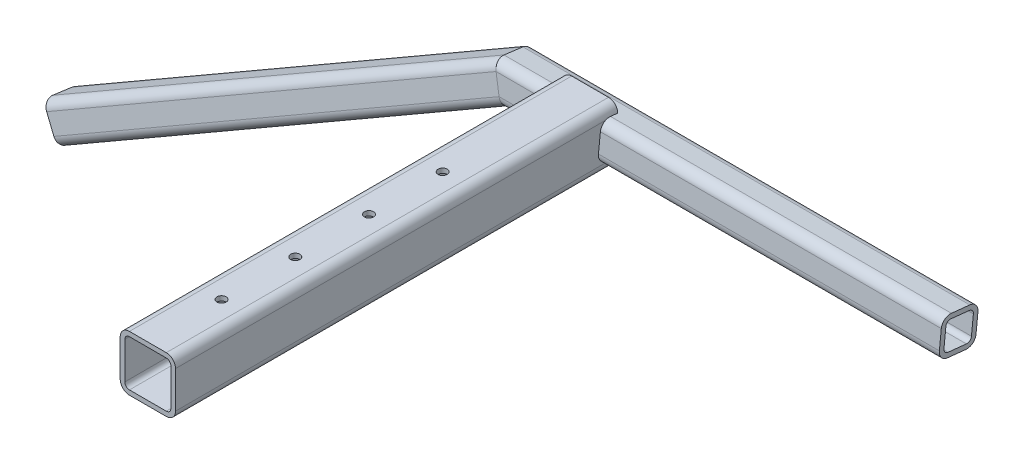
ISO-10303-21;
HEADER;
FILE_DESCRIPTION(('STEP AP214'),'2;1');
FILE_NAME('part.step','',(''),(''),'','','');
FILE_SCHEMA(('AUTOMOTIVE_DESIGN { 1 0 10303 214 1 1 1 1 }'));
ENDSEC;
DATA;
#1=APPLICATION_CONTEXT('core data for automotive mechanical design processes');
#2=APPLICATION_PROTOCOL_DEFINITION('international standard','automotive_design',2000,#1);
#3=PRODUCT_CONTEXT('',#1,'mechanical');
#4=PRODUCT('Part','Part','',(#3));
#5=PRODUCT_RELATED_PRODUCT_CATEGORY('part','',(#4));
#6=PRODUCT_DEFINITION_FORMATION('','',#4);
#7=PRODUCT_DEFINITION_CONTEXT('part definition',#1,'design');
#8=PRODUCT_DEFINITION('design','',#6,#7);
#9=PRODUCT_DEFINITION_SHAPE('','',#8);
#10=(LENGTH_UNIT() NAMED_UNIT(*) SI_UNIT(.MILLI.,.METRE.));
#11=(NAMED_UNIT(*) PLANE_ANGLE_UNIT() SI_UNIT($,.RADIAN.));
#12=(NAMED_UNIT(*) SI_UNIT($,.STERADIAN.) SOLID_ANGLE_UNIT());
#13=UNCERTAINTY_MEASURE_WITH_UNIT(LENGTH_MEASURE(1.E-05),#10,'distance_accuracy_value','');
#14=(GEOMETRIC_REPRESENTATION_CONTEXT(3) GLOBAL_UNCERTAINTY_ASSIGNED_CONTEXT((#13)) GLOBAL_UNIT_ASSIGNED_CONTEXT((#10,
#11,#12)) REPRESENTATION_CONTEXT('',''));
#15=CARTESIAN_POINT('',(0.,0.,0.));
#16=DIRECTION('',(0.,0.,1.));
#17=DIRECTION('',(1.,0.,0.));
#18=AXIS2_PLACEMENT_3D('',#15,#16,#17);
#19=CARTESIAN_POINT('',(-482.6,25.4,609.6));
#20=DIRECTION('',(0.,0.,-1.));
#21=DIRECTION('',(-1.,0.,0.));
#22=AXIS2_PLACEMENT_3D('',#19,#20,#21);
#23=CYLINDRICAL_SURFACE('',#22,12.7);
#24=CARTESIAN_POINT('',(-482.6,25.4,0.));
#25=DIRECTION('',(0.,0.,1.));
#26=DIRECTION('',(1.,0.,0.));
#27=AXIS2_PLACEMENT_3D('',#24,#25,#26);
#28=CIRCLE('',#27,12.7);
#29=CARTESIAN_POINT('',(-469.9,25.4,0.));
#30=VERTEX_POINT('',#29);
#31=CARTESIAN_POINT('',(-482.6,38.1,0.));
#32=VERTEX_POINT('',#31);
#33=EDGE_CURVE('E293',#30,#32,#28,.T.);
#34=ORIENTED_EDGE('',*,*,#33,.T.);
#35=DIRECTION('',(0.,0.,-1.));
#36=VECTOR('',#35,1.);
#37=CARTESIAN_POINT('',(-482.6,38.1,609.6));
#38=LINE('',#37,#36);
#39=CARTESIAN_POINT('',(-482.6,38.1,609.6));
#40=VERTEX_POINT('',#39);
#41=EDGE_CURVE('E13',#40,#32,#38,.T.);
#42=ORIENTED_EDGE('',*,*,#41,.F.);
#43=CARTESIAN_POINT('',(-482.6,25.4,609.6));
#44=DIRECTION('',(0.,0.,1.));
#45=DIRECTION('',(1.,0.,0.));
#46=AXIS2_PLACEMENT_3D('',#43,#44,#45);
#47=CIRCLE('',#46,12.7);
#48=CARTESIAN_POINT('',(-469.9,25.4,609.6));
#49=VERTEX_POINT('',#48);
#50=EDGE_CURVE('E428',#49,#40,#47,.T.);
#51=ORIENTED_EDGE('',*,*,#50,.F.);
#52=DIRECTION('',(0.,0.,-1.));
#53=VECTOR('',#52,1.);
#54=CARTESIAN_POINT('',(-469.9,25.4,609.6));
#55=LINE('',#54,#53);
#56=EDGE_CURVE('E316',#49,#30,#55,.T.);
#57=ORIENTED_EDGE('',*,*,#56,.T.);
#58=EDGE_LOOP('',(#34,#42,#51,#57));
#59=FACE_BOUND('',#58,.T.);
#60=ADVANCED_FACE('F106',(#59),#23,.T.);
#61=CARTESIAN_POINT('',(-482.6,38.1,609.6));
#62=DIRECTION('',(0.,-1.,0.));
#63=DIRECTION('',(0.,0.,-1.));
#64=AXIS2_PLACEMENT_3D('',#61,#62,#63);
#65=PLANE('',#64);
#66=CARTESIAN_POINT('',(-508.,38.1,508.));
#67=DIRECTION('',(0.,1.,0.));
#68=DIRECTION('',(0.,0.,1.));
#69=AXIS2_PLACEMENT_3D('',#66,#67,#68);
#70=CIRCLE('',#69,6.34999999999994);
#71=CARTESIAN_POINT('',(-508.,38.1,514.35));
#72=VERTEX_POINT('',#71);
#73=EDGE_CURVE('E361',#72,#72,#70,.T.);
#74=ORIENTED_EDGE('',*,*,#73,.F.);
#75=EDGE_LOOP('',(#74));
#76=FACE_BOUND('',#75,.T.);
#77=CARTESIAN_POINT('',(-508.,38.1,406.4));
#78=DIRECTION('',(0.,1.,0.));
#79=DIRECTION('',(0.,0.,1.));
#80=AXIS2_PLACEMENT_3D('',#77,#78,#79);
#81=CIRCLE('',#80,6.34999999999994);
#82=CARTESIAN_POINT('',(-508.,38.1,412.75));
#83=VERTEX_POINT('',#82);
#84=EDGE_CURVE('E831',#83,#83,#81,.T.);
#85=ORIENTED_EDGE('',*,*,#84,.F.);
#86=EDGE_LOOP('',(#85));
#87=FACE_BOUND('',#86,.T.);
#88=CARTESIAN_POINT('',(-508.,38.1,304.8));
#89=DIRECTION('',(0.,1.,0.));
#90=DIRECTION('',(0.,0.,1.));
#91=AXIS2_PLACEMENT_3D('',#88,#89,#90);
#92=CIRCLE('',#91,6.34999999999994);
#93=CARTESIAN_POINT('',(-508.,38.1,311.15));
#94=VERTEX_POINT('',#93);
#95=EDGE_CURVE('E827',#94,#94,#92,.T.);
#96=ORIENTED_EDGE('',*,*,#95,.F.);
#97=EDGE_LOOP('',(#96));
#98=FACE_BOUND('',#97,.T.);
#99=CARTESIAN_POINT('',(-508.,38.1,203.2));
#100=DIRECTION('',(0.,1.,0.));
#101=DIRECTION('',(0.,0.,1.));
#102=AXIS2_PLACEMENT_3D('',#99,#100,#101);
#103=CIRCLE('',#102,6.34999999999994);
#104=CARTESIAN_POINT('',(-508.,38.1,209.55));
#105=VERTEX_POINT('',#104);
#106=EDGE_CURVE('E823',#105,#105,#103,.T.);
#107=ORIENTED_EDGE('',*,*,#106,.F.);
#108=EDGE_LOOP('',(#107));
#109=FACE_BOUND('',#108,.T.);
#110=DIRECTION('',(-1.,0.,0.));
#111=VECTOR('',#110,1.);
#112=CARTESIAN_POINT('',(-482.6,38.1,0.));
#113=LINE('',#112,#111);
#114=CARTESIAN_POINT('',(-533.4,38.1,0.));
#115=VERTEX_POINT('',#114);
#116=EDGE_CURVE('E297',#32,#115,#113,.T.);
#117=ORIENTED_EDGE('',*,*,#116,.T.);
#118=DIRECTION('',(0.,0.,-1.));
#119=VECTOR('',#118,1.);
#120=CARTESIAN_POINT('',(-533.4,38.1,609.6));
#121=LINE('',#120,#119);
#122=CARTESIAN_POINT('',(-533.4,38.1,609.6));
#123=VERTEX_POINT('',#122);
#124=EDGE_CURVE('E117',#123,#115,#121,.T.);
#125=ORIENTED_EDGE('',*,*,#124,.F.);
#126=DIRECTION('',(-1.,0.,0.));
#127=VECTOR('',#126,1.);
#128=CARTESIAN_POINT('',(-482.6,38.1,609.6));
#129=LINE('',#128,#127);
#130=EDGE_CURVE('E431',#40,#123,#129,.T.);
#131=ORIENTED_EDGE('',*,*,#130,.F.);
#132=ORIENTED_EDGE('',*,*,#41,.T.);
#133=EDGE_LOOP('',(#117,#125,#131,#132));
#134=FACE_BOUND('',#133,.T.);
#135=ADVANCED_FACE('F493',(#76,#87,#98,#109,#134),#65,.F.);
#136=CARTESIAN_POINT('',(-533.4,25.4,609.6));
#137=DIRECTION('',(0.,0.,-1.));
#138=DIRECTION('',(-1.,0.,0.));
#139=AXIS2_PLACEMENT_3D('',#136,#137,#138);
#140=CYLINDRICAL_SURFACE('',#139,12.7);
#141=CARTESIAN_POINT('',(-533.4,25.4,0.));
#142=DIRECTION('',(0.,0.,1.));
#143=DIRECTION('',(1.,0.,0.));
#144=AXIS2_PLACEMENT_3D('',#141,#142,#143);
#145=CIRCLE('',#144,12.7);
#146=CARTESIAN_POINT('',(-546.1,25.4,0.));
#147=VERTEX_POINT('',#146);
#148=EDGE_CURVE('E300',#115,#147,#145,.T.);
#149=ORIENTED_EDGE('',*,*,#148,.T.);
#150=DIRECTION('',(0.,0.,-1.));
#151=VECTOR('',#150,1.);
#152=CARTESIAN_POINT('',(-546.1,25.4,609.6));
#153=LINE('',#152,#151);
#154=CARTESIAN_POINT('',(-546.1,25.4,609.6));
#155=VERTEX_POINT('',#154);
#156=EDGE_CURVE('E327',#155,#147,#153,.T.);
#157=ORIENTED_EDGE('',*,*,#156,.F.);
#158=CARTESIAN_POINT('',(-533.4,25.4,609.6));
#159=DIRECTION('',(0.,0.,1.));
#160=DIRECTION('',(1.,0.,0.));
#161=AXIS2_PLACEMENT_3D('',#158,#159,#160);
#162=CIRCLE('',#161,12.7);
#163=EDGE_CURVE('E434',#123,#155,#162,.T.);
#164=ORIENTED_EDGE('',*,*,#163,.F.);
#165=ORIENTED_EDGE('',*,*,#124,.T.);
#166=EDGE_LOOP('',(#149,#157,#164,#165));
#167=FACE_BOUND('',#166,.T.);
#168=ADVANCED_FACE('F499',(#167),#140,.T.);
#169=CARTESIAN_POINT('',(-546.1,-25.4,609.6));
#170=DIRECTION('',(1.,0.,0.));
#171=DIRECTION('',(0.,0.,-1.));
#172=AXIS2_PLACEMENT_3D('',#169,#170,#171);
#173=PLANE('',#172);
#174=DIRECTION('',(0.,-1.,0.));
#175=VECTOR('',#174,1.);
#176=CARTESIAN_POINT('',(-546.1,-25.4,0.));
#177=LINE('',#176,#175);
#178=CARTESIAN_POINT('',(-546.1,-25.4,0.));
#179=VERTEX_POINT('',#178);
#180=EDGE_CURVE('E303',#147,#179,#177,.T.);
#181=ORIENTED_EDGE('',*,*,#180,.T.);
#182=DIRECTION('',(0.,0.,-1.));
#183=VECTOR('',#182,1.);
#184=CARTESIAN_POINT('',(-546.1,-25.4,609.6));
#185=LINE('',#184,#183);
#186=CARTESIAN_POINT('',(-546.1,-25.4,609.6));
#187=VERTEX_POINT('',#186);
#188=EDGE_CURVE('E323',#187,#179,#185,.T.);
#189=ORIENTED_EDGE('',*,*,#188,.F.);
#190=DIRECTION('',(0.,-1.,0.));
#191=VECTOR('',#190,1.);
#192=CARTESIAN_POINT('',(-546.1,-25.4,609.6));
#193=LINE('',#192,#191);
#194=EDGE_CURVE('E437',#155,#187,#193,.T.);
#195=ORIENTED_EDGE('',*,*,#194,.F.);
#196=ORIENTED_EDGE('',*,*,#156,.T.);
#197=EDGE_LOOP('',(#181,#189,#195,#196));
#198=FACE_BOUND('',#197,.T.);
#199=ADVANCED_FACE('F731',(#198),#173,.F.);
#200=CARTESIAN_POINT('',(-533.4,-25.4,609.6));
#201=DIRECTION('',(0.,0.,-1.));
#202=DIRECTION('',(-1.,0.,0.));
#203=AXIS2_PLACEMENT_3D('',#200,#201,#202);
#204=CYLINDRICAL_SURFACE('',#203,12.7);
#205=CARTESIAN_POINT('',(-533.4,-25.4,0.));
#206=DIRECTION('',(0.,0.,1.));
#207=DIRECTION('',(1.,0.,0.));
#208=AXIS2_PLACEMENT_3D('',#205,#206,#207);
#209=CIRCLE('',#208,12.7);
#210=CARTESIAN_POINT('',(-533.4,-38.1,0.));
#211=VERTEX_POINT('',#210);
#212=EDGE_CURVE('E306',#179,#211,#209,.T.);
#213=ORIENTED_EDGE('',*,*,#212,.T.);
#214=DIRECTION('',(0.,0.,-1.));
#215=VECTOR('',#214,1.);
#216=CARTESIAN_POINT('',(-533.4,-38.1,609.6));
#217=LINE('',#216,#215);
#218=CARTESIAN_POINT('',(-533.4,-38.1,609.6));
#219=VERTEX_POINT('',#218);
#220=EDGE_CURVE('E249',#219,#211,#217,.T.);
#221=ORIENTED_EDGE('',*,*,#220,.F.);
#222=CARTESIAN_POINT('',(-533.4,-25.4,609.6));
#223=DIRECTION('',(0.,0.,1.));
#224=DIRECTION('',(1.,0.,0.));
#225=AXIS2_PLACEMENT_3D('',#222,#223,#224);
#226=CIRCLE('',#225,12.7);
#227=EDGE_CURVE('E238',#187,#219,#226,.T.);
#228=ORIENTED_EDGE('',*,*,#227,.F.);
#229=ORIENTED_EDGE('',*,*,#188,.T.);
#230=EDGE_LOOP('',(#213,#221,#228,#229));
#231=FACE_BOUND('',#230,.T.);
#232=ADVANCED_FACE('F720',(#231),#204,.T.);
#233=CARTESIAN_POINT('',(-533.4,-38.1,609.6));
#234=DIRECTION('',(0.,1.,0.));
#235=DIRECTION('',(0.,0.,1.));
#236=AXIS2_PLACEMENT_3D('',#233,#234,#235);
#237=PLANE('',#236);
#238=CARTESIAN_POINT('',(-508.,-38.1,508.));
#239=DIRECTION('',(0.,1.,0.));
#240=DIRECTION('',(0.,0.,1.));
#241=AXIS2_PLACEMENT_3D('',#238,#239,#240);
#242=CIRCLE('',#241,6.34999999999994);
#243=CARTESIAN_POINT('',(-508.,-38.1,514.35));
#244=VERTEX_POINT('',#243);
#245=EDGE_CURVE('E265',#244,#244,#242,.T.);
#246=ORIENTED_EDGE('',*,*,#245,.T.);
#247=EDGE_LOOP('',(#246));
#248=FACE_BOUND('',#247,.T.);
#249=CARTESIAN_POINT('',(-508.,-38.1,406.4));
#250=DIRECTION('',(0.,1.,0.));
#251=DIRECTION('',(0.,0.,1.));
#252=AXIS2_PLACEMENT_3D('',#249,#250,#251);
#253=CIRCLE('',#252,6.34999999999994);
#254=CARTESIAN_POINT('',(-508.,-38.1,412.75));
#255=VERTEX_POINT('',#254);
#256=EDGE_CURVE('E377',#255,#255,#253,.T.);
#257=ORIENTED_EDGE('',*,*,#256,.T.);
#258=EDGE_LOOP('',(#257));
#259=FACE_BOUND('',#258,.T.);
#260=CARTESIAN_POINT('',(-508.,-38.1,304.8));
#261=DIRECTION('',(0.,1.,0.));
#262=DIRECTION('',(0.,0.,1.));
#263=AXIS2_PLACEMENT_3D('',#260,#261,#262);
#264=CIRCLE('',#263,6.34999999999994);
#265=CARTESIAN_POINT('',(-508.,-38.1,311.15));
#266=VERTEX_POINT('',#265);
#267=EDGE_CURVE('E371',#266,#266,#264,.T.);
#268=ORIENTED_EDGE('',*,*,#267,.T.);
#269=EDGE_LOOP('',(#268));
#270=FACE_BOUND('',#269,.T.);
#271=CARTESIAN_POINT('',(-508.,-38.1,203.2));
#272=DIRECTION('',(0.,1.,0.));
#273=DIRECTION('',(0.,0.,1.));
#274=AXIS2_PLACEMENT_3D('',#271,#272,#273);
#275=CIRCLE('',#274,6.34999999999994);
#276=CARTESIAN_POINT('',(-508.,-38.1,209.55));
#277=VERTEX_POINT('',#276);
#278=EDGE_CURVE('E366',#277,#277,#275,.T.);
#279=ORIENTED_EDGE('',*,*,#278,.T.);
#280=EDGE_LOOP('',(#279));
#281=FACE_BOUND('',#280,.T.);
#282=DIRECTION('',(1.,0.,0.));
#283=VECTOR('',#282,1.);
#284=CARTESIAN_POINT('',(-533.4,-38.1,0.));
#285=LINE('',#284,#283);
#286=CARTESIAN_POINT('',(-482.6,-38.1,0.));
#287=VERTEX_POINT('',#286);
#288=EDGE_CURVE('E247',#211,#287,#285,.T.);
#289=ORIENTED_EDGE('',*,*,#288,.T.);
#290=DIRECTION('',(0.,0.,-1.));
#291=VECTOR('',#290,1.);
#292=CARTESIAN_POINT('',(-482.6,-38.1,609.6));
#293=LINE('',#292,#291);
#294=CARTESIAN_POINT('',(-482.6,-38.1,609.6));
#295=VERTEX_POINT('',#294);
#296=EDGE_CURVE('E244',#295,#287,#293,.T.);
#297=ORIENTED_EDGE('',*,*,#296,.F.);
#298=DIRECTION('',(1.,0.,0.));
#299=VECTOR('',#298,1.);
#300=CARTESIAN_POINT('',(-533.4,-38.1,609.6));
#301=LINE('',#300,#299);
#302=EDGE_CURVE('E232',#219,#295,#301,.T.);
#303=ORIENTED_EDGE('',*,*,#302,.F.);
#304=ORIENTED_EDGE('',*,*,#220,.T.);
#305=EDGE_LOOP('',(#289,#297,#303,#304));
#306=FACE_BOUND('',#305,.T.);
#307=ADVANCED_FACE('F245',(#248,#259,#270,#281,#306),#237,.F.);
#308=CARTESIAN_POINT('',(-482.6,-25.4,609.6));
#309=DIRECTION('',(0.,0.,-1.));
#310=DIRECTION('',(-1.,0.,0.));
#311=AXIS2_PLACEMENT_3D('',#308,#309,#310);
#312=CYLINDRICAL_SURFACE('',#311,12.7);
#313=CARTESIAN_POINT('',(-482.6,-25.4,0.));
#314=DIRECTION('',(0.,0.,1.));
#315=DIRECTION('',(1.,0.,0.));
#316=AXIS2_PLACEMENT_3D('',#313,#314,#315);
#317=CIRCLE('',#316,12.7);
#318=CARTESIAN_POINT('',(-469.9,-25.4,0.));
#319=VERTEX_POINT('',#318);
#320=EDGE_CURVE('E179',#287,#319,#317,.T.);
#321=ORIENTED_EDGE('',*,*,#320,.T.);
#322=DIRECTION('',(0.,0.,-1.));
#323=VECTOR('',#322,1.);
#324=CARTESIAN_POINT('',(-469.9,-25.4,609.6));
#325=LINE('',#324,#323);
#326=CARTESIAN_POINT('',(-469.9,-25.4,609.6));
#327=VERTEX_POINT('',#326);
#328=EDGE_CURVE('E250',#327,#319,#325,.T.);
#329=ORIENTED_EDGE('',*,*,#328,.F.);
#330=CARTESIAN_POINT('',(-482.6,-25.4,609.6));
#331=DIRECTION('',(0.,0.,1.));
#332=DIRECTION('',(1.,0.,0.));
#333=AXIS2_PLACEMENT_3D('',#330,#331,#332);
#334=CIRCLE('',#333,12.7);
#335=EDGE_CURVE('E236',#295,#327,#334,.T.);
#336=ORIENTED_EDGE('',*,*,#335,.F.);
#337=ORIENTED_EDGE('',*,*,#296,.T.);
#338=EDGE_LOOP('',(#321,#329,#336,#337));
#339=FACE_BOUND('',#338,.T.);
#340=ADVANCED_FACE('F252',(#339),#312,.T.);
#341=CARTESIAN_POINT('',(-533.4,25.4,609.6));
#342=DIRECTION('',(0.,0.,-1.));
#343=DIRECTION('',(-1.,0.,0.));
#344=AXIS2_PLACEMENT_3D('',#341,#342,#343);
#345=CYLINDRICAL_SURFACE('',#344,6.34999999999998);
#346=CARTESIAN_POINT('',(-533.4,25.4,0.));
#347=DIRECTION('',(0.,0.,1.));
#348=DIRECTION('',(1.,0.,0.));
#349=AXIS2_PLACEMENT_3D('',#346,#347,#348);
#350=CIRCLE('',#349,6.34999999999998);
#351=CARTESIAN_POINT('',(-533.4,31.75,0.));
#352=VERTEX_POINT('',#351);
#353=CARTESIAN_POINT('',(-539.75,25.4,0.));
#354=VERTEX_POINT('',#353);
#355=EDGE_CURVE('E260',#352,#354,#350,.T.);
#356=ORIENTED_EDGE('',*,*,#355,.F.);
#357=DIRECTION('',(0.,0.,-1.));
#358=VECTOR('',#357,1.);
#359=CARTESIAN_POINT('',(-533.4,31.75,609.6));
#360=LINE('',#359,#358);
#361=CARTESIAN_POINT('',(-533.4,31.75,609.6));
#362=VERTEX_POINT('',#361);
#363=EDGE_CURVE('E193',#362,#352,#360,.T.);
#364=ORIENTED_EDGE('',*,*,#363,.F.);
#365=CARTESIAN_POINT('',(-533.4,25.4,609.6));
#366=DIRECTION('',(0.,0.,1.));
#367=DIRECTION('',(1.,0.,0.));
#368=AXIS2_PLACEMENT_3D('',#365,#366,#367);
#369=CIRCLE('',#368,6.34999999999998);
#370=CARTESIAN_POINT('',(-539.75,25.4,609.6));
#371=VERTEX_POINT('',#370);
#372=EDGE_CURVE('E315',#362,#371,#369,.T.);
#373=ORIENTED_EDGE('',*,*,#372,.T.);
#374=DIRECTION('',(0.,0.,-1.));
#375=VECTOR('',#374,1.);
#376=CARTESIAN_POINT('',(-539.75,25.4,609.6));
#377=LINE('',#376,#375);
#378=EDGE_CURVE('E256',#371,#354,#377,.T.);
#379=ORIENTED_EDGE('',*,*,#378,.T.);
#380=EDGE_LOOP('',(#356,#364,#373,#379));
#381=FACE_BOUND('',#380,.T.);
#382=ADVANCED_FACE('F108',(#381),#345,.F.);
#383=CARTESIAN_POINT('',(-482.6,31.75,609.6));
#384=DIRECTION('',(0.,-1.,0.));
#385=DIRECTION('',(0.,0.,-1.));
#386=AXIS2_PLACEMENT_3D('',#383,#384,#385);
#387=PLANE('',#386);
#388=CARTESIAN_POINT('',(-508.,31.75,508.));
#389=DIRECTION('',(0.,-1.,0.));
#390=DIRECTION('',(0.,0.,-1.));
#391=AXIS2_PLACEMENT_3D('',#388,#389,#390);
#392=CIRCLE('',#391,6.34999999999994);
#393=CARTESIAN_POINT('',(-508.,31.75,501.65));
#394=VERTEX_POINT('',#393);
#395=EDGE_CURVE('E391',#394,#394,#392,.T.);
#396=ORIENTED_EDGE('',*,*,#395,.F.);
#397=EDGE_LOOP('',(#396));
#398=FACE_BOUND('',#397,.T.);
#399=CARTESIAN_POINT('',(-508.,31.75,406.4));
#400=DIRECTION('',(0.,-1.,0.));
#401=DIRECTION('',(0.,0.,-1.));
#402=AXIS2_PLACEMENT_3D('',#399,#400,#401);
#403=CIRCLE('',#402,6.34999999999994);
#404=CARTESIAN_POINT('',(-508.,31.75,400.05));
#405=VERTEX_POINT('',#404);
#406=EDGE_CURVE('E370',#405,#405,#403,.T.);
#407=ORIENTED_EDGE('',*,*,#406,.F.);
#408=EDGE_LOOP('',(#407));
#409=FACE_BOUND('',#408,.T.);
#410=CARTESIAN_POINT('',(-508.,31.75,304.8));
#411=DIRECTION('',(0.,-1.,0.));
#412=DIRECTION('',(0.,0.,-1.));
#413=AXIS2_PLACEMENT_3D('',#410,#411,#412);
#414=CIRCLE('',#413,6.34999999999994);
#415=CARTESIAN_POINT('',(-508.,31.75,298.45));
#416=VERTEX_POINT('',#415);
#417=EDGE_CURVE('E365',#416,#416,#414,.T.);
#418=ORIENTED_EDGE('',*,*,#417,.F.);
#419=EDGE_LOOP('',(#418));
#420=FACE_BOUND('',#419,.T.);
#421=CARTESIAN_POINT('',(-508.,31.75,203.2));
#422=DIRECTION('',(0.,-1.,0.));
#423=DIRECTION('',(0.,0.,-1.));
#424=AXIS2_PLACEMENT_3D('',#421,#422,#423);
#425=CIRCLE('',#424,6.34999999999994);
#426=CARTESIAN_POINT('',(-508.,31.75,196.85));
#427=VERTEX_POINT('',#426);
#428=EDGE_CURVE('E360',#427,#427,#425,.T.);
#429=ORIENTED_EDGE('',*,*,#428,.F.);
#430=EDGE_LOOP('',(#429));
#431=FACE_BOUND('',#430,.T.);
#432=DIRECTION('',(-1.,0.,0.));
#433=VECTOR('',#432,1.);
#434=CARTESIAN_POINT('',(-482.6,31.75,0.));
#435=LINE('',#434,#433);
#436=CARTESIAN_POINT('',(-482.6,31.75,0.));
#437=VERTEX_POINT('',#436);
#438=EDGE_CURVE('E264',#437,#352,#435,.T.);
#439=ORIENTED_EDGE('',*,*,#438,.F.);
#440=DIRECTION('',(0.,0.,-1.));
#441=VECTOR('',#440,1.);
#442=CARTESIAN_POINT('',(-482.6,31.75,609.6));
#443=LINE('',#442,#441);
#444=CARTESIAN_POINT('',(-482.6,31.75,609.6));
#445=VERTEX_POINT('',#444);
#446=EDGE_CURVE('E351',#445,#437,#443,.T.);
#447=ORIENTED_EDGE('',*,*,#446,.F.);
#448=DIRECTION('',(-1.,0.,0.));
#449=VECTOR('',#448,1.);
#450=CARTESIAN_POINT('',(-482.6,31.75,609.6));
#451=LINE('',#450,#449);
#452=EDGE_CURVE('E400',#445,#362,#451,.T.);
#453=ORIENTED_EDGE('',*,*,#452,.T.);
#454=ORIENTED_EDGE('',*,*,#363,.T.);
#455=EDGE_LOOP('',(#439,#447,#453,#454));
#456=FACE_BOUND('',#455,.T.);
#457=ADVANCED_FACE('F477',(#398,#409,#420,#431,#456),#387,.T.);
#458=CARTESIAN_POINT('',(-482.6,25.4,609.6));
#459=DIRECTION('',(0.,0.,-1.));
#460=DIRECTION('',(-1.,0.,0.));
#461=AXIS2_PLACEMENT_3D('',#458,#459,#460);
#462=CYLINDRICAL_SURFACE('',#461,6.35000000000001);
#463=CARTESIAN_POINT('',(-482.6,25.4,0.));
#464=DIRECTION('',(0.,0.,1.));
#465=DIRECTION('',(1.,0.,0.));
#466=AXIS2_PLACEMENT_3D('',#463,#464,#465);
#467=CIRCLE('',#466,6.35000000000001);
#468=CARTESIAN_POINT('',(-476.25,25.4,0.));
#469=VERTEX_POINT('',#468);
#470=EDGE_CURVE('E269',#469,#437,#467,.T.);
#471=ORIENTED_EDGE('',*,*,#470,.F.);
#472=DIRECTION('',(0.,0.,-1.));
#473=VECTOR('',#472,1.);
#474=CARTESIAN_POINT('',(-476.25,25.4,609.6));
#475=LINE('',#474,#473);
#476=CARTESIAN_POINT('',(-476.25,25.4,609.6));
#477=VERTEX_POINT('',#476);
#478=EDGE_CURVE('E348',#477,#469,#475,.T.);
#479=ORIENTED_EDGE('',*,*,#478,.F.);
#480=CARTESIAN_POINT('',(-482.6,25.4,609.6));
#481=DIRECTION('',(0.,0.,1.));
#482=DIRECTION('',(1.,0.,0.));
#483=AXIS2_PLACEMENT_3D('',#480,#481,#482);
#484=CIRCLE('',#483,6.35000000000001);
#485=EDGE_CURVE('E404',#477,#445,#484,.T.);
#486=ORIENTED_EDGE('',*,*,#485,.T.);
#487=ORIENTED_EDGE('',*,*,#446,.T.);
#488=EDGE_LOOP('',(#471,#479,#486,#487));
#489=FACE_BOUND('',#488,.T.);
#490=ADVANCED_FACE('F480',(#489),#462,.F.);
#491=CARTESIAN_POINT('',(-476.25,25.4,609.6));
#492=DIRECTION('',(-1.,0.,0.));
#493=DIRECTION('',(0.,0.,1.));
#494=AXIS2_PLACEMENT_3D('',#491,#492,#493);
#495=PLANE('',#494);
#496=DIRECTION('',(0.,1.,0.));
#497=VECTOR('',#496,1.);
#498=CARTESIAN_POINT('',(-476.25,25.4,0.));
#499=LINE('',#498,#497);
#500=CARTESIAN_POINT('',(-476.25,-25.4,0.));
#501=VERTEX_POINT('',#500);
#502=EDGE_CURVE('E273',#501,#469,#499,.T.);
#503=ORIENTED_EDGE('',*,*,#502,.F.);
#504=DIRECTION('',(0.,0.,-1.));
#505=VECTOR('',#504,1.);
#506=CARTESIAN_POINT('',(-476.25,-25.4,609.6));
#507=LINE('',#506,#505);
#508=CARTESIAN_POINT('',(-476.25,-25.4,609.6));
#509=VERTEX_POINT('',#508);
#510=EDGE_CURVE('E345',#509,#501,#507,.T.);
#511=ORIENTED_EDGE('',*,*,#510,.F.);
#512=DIRECTION('',(0.,1.,0.));
#513=VECTOR('',#512,1.);
#514=CARTESIAN_POINT('',(-476.25,25.4,609.6));
#515=LINE('',#514,#513);
#516=EDGE_CURVE('E408',#509,#477,#515,.T.);
#517=ORIENTED_EDGE('',*,*,#516,.T.);
#518=ORIENTED_EDGE('',*,*,#478,.T.);
#519=EDGE_LOOP('',(#503,#511,#517,#518));
#520=FACE_BOUND('',#519,.T.);
#521=ADVANCED_FACE('F484',(#520),#495,.T.);
#522=CARTESIAN_POINT('',(-482.6,-25.4,609.6));
#523=DIRECTION('',(0.,0.,-1.));
#524=DIRECTION('',(-1.,0.,0.));
#525=AXIS2_PLACEMENT_3D('',#522,#523,#524);
#526=CYLINDRICAL_SURFACE('',#525,6.35000000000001);
#527=CARTESIAN_POINT('',(-482.6,-25.4,0.));
#528=DIRECTION('',(0.,0.,1.));
#529=DIRECTION('',(1.,0.,0.));
#530=AXIS2_PLACEMENT_3D('',#527,#528,#529);
#531=CIRCLE('',#530,6.35000000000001);
#532=CARTESIAN_POINT('',(-482.6,-31.75,0.));
#533=VERTEX_POINT('',#532);
#534=EDGE_CURVE('E277',#533,#501,#531,.T.);
#535=ORIENTED_EDGE('',*,*,#534,.F.);
#536=DIRECTION('',(0.,0.,-1.));
#537=VECTOR('',#536,1.);
#538=CARTESIAN_POINT('',(-482.6,-31.75,609.6));
#539=LINE('',#538,#537);
#540=CARTESIAN_POINT('',(-482.6,-31.75,609.6));
#541=VERTEX_POINT('',#540);
#542=EDGE_CURVE('E342',#541,#533,#539,.T.);
#543=ORIENTED_EDGE('',*,*,#542,.F.);
#544=CARTESIAN_POINT('',(-482.6,-25.4,609.6));
#545=DIRECTION('',(0.,0.,1.));
#546=DIRECTION('',(1.,0.,0.));
#547=AXIS2_PLACEMENT_3D('',#544,#545,#546);
#548=CIRCLE('',#547,6.35000000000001);
#549=EDGE_CURVE('E412',#541,#509,#548,.T.);
#550=ORIENTED_EDGE('',*,*,#549,.T.);
#551=ORIENTED_EDGE('',*,*,#510,.T.);
#552=EDGE_LOOP('',(#535,#543,#550,#551));
#553=FACE_BOUND('',#552,.T.);
#554=ADVANCED_FACE('F451',(#553),#526,.F.);
#555=CARTESIAN_POINT('',(-533.4,-31.75,609.6));
#556=DIRECTION('',(0.,1.,0.));
#557=DIRECTION('',(0.,0.,1.));
#558=AXIS2_PLACEMENT_3D('',#555,#556,#557);
#559=PLANE('',#558);
#560=CARTESIAN_POINT('',(-508.,-31.75,508.));
#561=DIRECTION('',(0.,1.,0.));
#562=DIRECTION('',(0.,0.,1.));
#563=AXIS2_PLACEMENT_3D('',#560,#561,#562);
#564=CIRCLE('',#563,6.34999999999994);
#565=CARTESIAN_POINT('',(-508.,-31.7500000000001,514.35));
#566=VERTEX_POINT('',#565);
#567=EDGE_CURVE('E110',#566,#566,#564,.T.);
#568=ORIENTED_EDGE('',*,*,#567,.F.);
#569=EDGE_LOOP('',(#568));
#570=FACE_BOUND('',#569,.T.);
#571=CARTESIAN_POINT('',(-508.,-31.75,406.4));
#572=DIRECTION('',(0.,1.,0.));
#573=DIRECTION('',(0.,0.,1.));
#574=AXIS2_PLACEMENT_3D('',#571,#572,#573);
#575=CIRCLE('',#574,6.34999999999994);
#576=CARTESIAN_POINT('',(-508.,-31.7500000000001,412.75));
#577=VERTEX_POINT('',#576);
#578=EDGE_CURVE('E367',#577,#577,#575,.T.);
#579=ORIENTED_EDGE('',*,*,#578,.F.);
#580=EDGE_LOOP('',(#579));
#581=FACE_BOUND('',#580,.T.);
#582=CARTESIAN_POINT('',(-508.,-31.75,304.8));
#583=DIRECTION('',(0.,1.,0.));
#584=DIRECTION('',(0.,0.,1.));
#585=AXIS2_PLACEMENT_3D('',#582,#583,#584);
#586=CIRCLE('',#585,6.34999999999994);
#587=CARTESIAN_POINT('',(-508.,-31.7500000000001,311.15));
#588=VERTEX_POINT('',#587);
#589=EDGE_CURVE('E362',#588,#588,#586,.T.);
#590=ORIENTED_EDGE('',*,*,#589,.F.);
#591=EDGE_LOOP('',(#590));
#592=FACE_BOUND('',#591,.T.);
#593=CARTESIAN_POINT('',(-508.,-31.75,203.2));
#594=DIRECTION('',(0.,1.,0.));
#595=DIRECTION('',(0.,0.,1.));
#596=AXIS2_PLACEMENT_3D('',#593,#594,#595);
#597=CIRCLE('',#596,6.34999999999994);
#598=CARTESIAN_POINT('',(-508.,-31.7500000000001,209.55));
#599=VERTEX_POINT('',#598);
#600=EDGE_CURVE('E356',#599,#599,#597,.T.);
#601=ORIENTED_EDGE('',*,*,#600,.F.);
#602=EDGE_LOOP('',(#601));
#603=FACE_BOUND('',#602,.T.);
#604=DIRECTION('',(1.,0.,0.));
#605=VECTOR('',#604,1.);
#606=CARTESIAN_POINT('',(-533.4,-31.75,0.));
#607=LINE('',#606,#605);
#608=CARTESIAN_POINT('',(-533.4,-31.75,0.));
#609=VERTEX_POINT('',#608);
#610=EDGE_CURVE('E281',#609,#533,#607,.T.);
#611=ORIENTED_EDGE('',*,*,#610,.F.);
#612=DIRECTION('',(0.,0.,-1.));
#613=VECTOR('',#612,1.);
#614=CARTESIAN_POINT('',(-533.4,-31.75,609.6));
#615=LINE('',#614,#613);
#616=CARTESIAN_POINT('',(-533.4,-31.75,609.6));
#617=VERTEX_POINT('',#616);
#618=EDGE_CURVE('E339',#617,#609,#615,.T.);
#619=ORIENTED_EDGE('',*,*,#618,.F.);
#620=DIRECTION('',(1.,0.,0.));
#621=VECTOR('',#620,1.);
#622=CARTESIAN_POINT('',(-533.4,-31.75,609.6));
#623=LINE('',#622,#621);
#624=EDGE_CURVE('E416',#617,#541,#623,.T.);
#625=ORIENTED_EDGE('',*,*,#624,.T.);
#626=ORIENTED_EDGE('',*,*,#542,.T.);
#627=EDGE_LOOP('',(#611,#619,#625,#626));
#628=FACE_BOUND('',#627,.T.);
#629=ADVANCED_FACE('F447',(#570,#581,#592,#603,#628),#559,.T.);
#630=CARTESIAN_POINT('',(-533.4,-25.4,609.6));
#631=DIRECTION('',(0.,0.,-1.));
#632=DIRECTION('',(-1.,0.,0.));
#633=AXIS2_PLACEMENT_3D('',#630,#631,#632);
#634=CYLINDRICAL_SURFACE('',#633,6.34999999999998);
#635=CARTESIAN_POINT('',(-533.4,-25.4,0.));
#636=DIRECTION('',(0.,0.,1.));
#637=DIRECTION('',(1.,0.,0.));
#638=AXIS2_PLACEMENT_3D('',#635,#636,#637);
#639=CIRCLE('',#638,6.34999999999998);
#640=CARTESIAN_POINT('',(-539.75,-25.4,0.));
#641=VERTEX_POINT('',#640);
#642=EDGE_CURVE('E285',#641,#609,#639,.T.);
#643=ORIENTED_EDGE('',*,*,#642,.F.);
#644=DIRECTION('',(0.,0.,-1.));
#645=VECTOR('',#644,1.);
#646=CARTESIAN_POINT('',(-539.75,-25.4,609.6));
#647=LINE('',#646,#645);
#648=CARTESIAN_POINT('',(-539.75,-25.4,609.6));
#649=VERTEX_POINT('',#648);
#650=EDGE_CURVE('E336',#649,#641,#647,.T.);
#651=ORIENTED_EDGE('',*,*,#650,.F.);
#652=CARTESIAN_POINT('',(-533.4,-25.4,609.6));
#653=DIRECTION('',(0.,0.,1.));
#654=DIRECTION('',(1.,0.,0.));
#655=AXIS2_PLACEMENT_3D('',#652,#653,#654);
#656=CIRCLE('',#655,6.34999999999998);
#657=EDGE_CURVE('E420',#649,#617,#656,.T.);
#658=ORIENTED_EDGE('',*,*,#657,.T.);
#659=ORIENTED_EDGE('',*,*,#618,.T.);
#660=EDGE_LOOP('',(#643,#651,#658,#659));
#661=FACE_BOUND('',#660,.T.);
#662=ADVANCED_FACE('F450',(#661),#634,.F.);
#663=CARTESIAN_POINT('',(-539.75,-25.4,609.6));
#664=DIRECTION('',(1.,0.,0.));
#665=DIRECTION('',(0.,0.,-1.));
#666=AXIS2_PLACEMENT_3D('',#663,#664,#665);
#667=PLANE('',#666);
#668=DIRECTION('',(0.,-1.,0.));
#669=VECTOR('',#668,1.);
#670=CARTESIAN_POINT('',(-539.75,-25.4,0.));
#671=LINE('',#670,#669);
#672=EDGE_CURVE('E289',#354,#641,#671,.T.);
#673=ORIENTED_EDGE('',*,*,#672,.F.);
#674=ORIENTED_EDGE('',*,*,#378,.F.);
#675=DIRECTION('',(0.,-1.,0.));
#676=VECTOR('',#675,1.);
#677=CARTESIAN_POINT('',(-539.75,-25.4,609.6));
#678=LINE('',#677,#676);
#679=EDGE_CURVE('E424',#371,#649,#678,.T.);
#680=ORIENTED_EDGE('',*,*,#679,.T.);
#681=ORIENTED_EDGE('',*,*,#650,.T.);
#682=EDGE_LOOP('',(#673,#674,#680,#681));
#683=FACE_BOUND('',#682,.T.);
#684=ADVANCED_FACE('F472',(#683),#667,.T.);
#685=CARTESIAN_POINT('',(-469.9,25.4,609.6));
#686=DIRECTION('',(-1.,0.,0.));
#687=DIRECTION('',(0.,0.,1.));
#688=AXIS2_PLACEMENT_3D('',#685,#686,#687);
#689=PLANE('',#688);
#690=DIRECTION('',(0.,1.,0.));
#691=VECTOR('',#690,1.);
#692=CARTESIAN_POINT('',(-469.9,25.4,0.));
#693=LINE('',#692,#691);
#694=EDGE_CURVE('E185',#319,#30,#693,.T.);
#695=ORIENTED_EDGE('',*,*,#694,.T.);
#696=ORIENTED_EDGE('',*,*,#56,.F.);
#697=DIRECTION('',(0.,1.,0.));
#698=VECTOR('',#697,1.);
#699=CARTESIAN_POINT('',(-469.9,25.4,609.6));
#700=LINE('',#699,#698);
#701=EDGE_CURVE('E126',#327,#49,#700,.T.);
#702=ORIENTED_EDGE('',*,*,#701,.F.);
#703=ORIENTED_EDGE('',*,*,#328,.T.);
#704=EDGE_LOOP('',(#695,#696,#702,#703));
#705=FACE_BOUND('',#704,.T.);
#706=ADVANCED_FACE('F506',(#705),#689,.F.);
#707=CARTESIAN_POINT('',(-482.6,25.4,609.6));
#708=DIRECTION('',(0.,0.,1.));
#709=DIRECTION('',(1.,0.,0.));
#710=AXIS2_PLACEMENT_3D('',#707,#708,#709);
#711=PLANE('',#710);
#712=ORIENTED_EDGE('',*,*,#372,.F.);
#713=ORIENTED_EDGE('',*,*,#452,.F.);
#714=ORIENTED_EDGE('',*,*,#485,.F.);
#715=ORIENTED_EDGE('',*,*,#516,.F.);
#716=ORIENTED_EDGE('',*,*,#549,.F.);
#717=ORIENTED_EDGE('',*,*,#624,.F.);
#718=ORIENTED_EDGE('',*,*,#657,.F.);
#719=ORIENTED_EDGE('',*,*,#679,.F.);
#720=EDGE_LOOP('',(#712,#713,#714,#715,#716,#717,#718,#719));
#721=FACE_BOUND('',#720,.T.);
#722=ORIENTED_EDGE('',*,*,#50,.T.);
#723=ORIENTED_EDGE('',*,*,#130,.T.);
#724=ORIENTED_EDGE('',*,*,#163,.T.);
#725=ORIENTED_EDGE('',*,*,#194,.T.);
#726=ORIENTED_EDGE('',*,*,#227,.T.);
#727=ORIENTED_EDGE('',*,*,#302,.T.);
#728=ORIENTED_EDGE('',*,*,#335,.T.);
#729=ORIENTED_EDGE('',*,*,#701,.T.);
#730=EDGE_LOOP('',(#722,#723,#724,#725,#726,#727,#728,#729));
#731=FACE_BOUND('',#730,.T.);
#732=ADVANCED_FACE('F234',(#721,#731),#711,.T.);
#733=CARTESIAN_POINT('',(-482.6,25.4,0.));
#734=DIRECTION('',(0.,0.,1.));
#735=DIRECTION('',(1.,0.,0.));
#736=AXIS2_PLACEMENT_3D('',#733,#734,#735);
#737=PLANE('',#736);
#738=ORIENTED_EDGE('',*,*,#355,.T.);
#739=ORIENTED_EDGE('',*,*,#672,.T.);
#740=ORIENTED_EDGE('',*,*,#642,.T.);
#741=ORIENTED_EDGE('',*,*,#610,.T.);
#742=ORIENTED_EDGE('',*,*,#534,.T.);
#743=ORIENTED_EDGE('',*,*,#502,.T.);
#744=ORIENTED_EDGE('',*,*,#470,.T.);
#745=ORIENTED_EDGE('',*,*,#438,.T.);
#746=EDGE_LOOP('',(#738,#739,#740,#741,#742,#743,#744,#745));
#747=FACE_BOUND('',#746,.T.);
#748=ORIENTED_EDGE('',*,*,#33,.F.);
#749=ORIENTED_EDGE('',*,*,#694,.F.);
#750=ORIENTED_EDGE('',*,*,#320,.F.);
#751=ORIENTED_EDGE('',*,*,#288,.F.);
#752=ORIENTED_EDGE('',*,*,#212,.F.);
#753=ORIENTED_EDGE('',*,*,#180,.F.);
#754=ORIENTED_EDGE('',*,*,#148,.F.);
#755=ORIENTED_EDGE('',*,*,#116,.F.);
#756=EDGE_LOOP('',(#748,#749,#750,#751,#752,#753,#754,#755));
#757=FACE_BOUND('',#756,.T.);
#758=ADVANCED_FACE('F463',(#747,#757),#737,.F.);
#759=CARTESIAN_POINT('',(-508.,-378.6864528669,203.2));
#760=DIRECTION('',(0.,1.,0.));
#761=DIRECTION('',(0.,0.,1.));
#762=AXIS2_PLACEMENT_3D('',#759,#760,#761);
#763=CYLINDRICAL_SURFACE('',#762,6.34999999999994);
#764=CARTESIAN_POINT('',(-508.,-31.7500000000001,209.55));
#765=CARTESIAN_POINT('',(-508.,-31.8161458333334,209.55));
#766=CARTESIAN_POINT('',(-508.,-31.8822916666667,209.55));
#767=CARTESIAN_POINT('',(-508.,-32.0145833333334,209.55));
#768=CARTESIAN_POINT('',(-508.,-32.0807291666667,209.55));
#769=CARTESIAN_POINT('',(-508.,-32.2130208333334,209.55));
#770=CARTESIAN_POINT('',(-508.,-32.2791666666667,209.55));
#771=CARTESIAN_POINT('',(-508.,-32.4114583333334,209.55));
#772=CARTESIAN_POINT('',(-508.,-32.4776041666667,209.55));
#773=CARTESIAN_POINT('',(-508.,-32.6098958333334,209.55));
#774=CARTESIAN_POINT('',(-508.,-32.6760416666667,209.55));
#775=CARTESIAN_POINT('',(-508.,-32.8083333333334,209.55));
#776=CARTESIAN_POINT('',(-508.,-32.8744791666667,209.55));
#777=CARTESIAN_POINT('',(-508.,-33.0067708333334,209.55));
#778=CARTESIAN_POINT('',(-508.,-33.0729166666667,209.55));
#779=CARTESIAN_POINT('',(-508.,-33.2052083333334,209.55));
#780=CARTESIAN_POINT('',(-508.,-33.2713541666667,209.55));
#781=CARTESIAN_POINT('',(-508.,-33.4036458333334,209.55));
#782=CARTESIAN_POINT('',(-508.,-33.4697916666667,209.55));
#783=CARTESIAN_POINT('',(-508.,-33.6020833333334,209.55));
#784=CARTESIAN_POINT('',(-508.,-33.6682291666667,209.55));
#785=CARTESIAN_POINT('',(-508.,-33.8005208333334,209.55));
#786=CARTESIAN_POINT('',(-508.,-33.8666666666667,209.55));
#787=CARTESIAN_POINT('',(-508.,-33.9989583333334,209.55));
#788=CARTESIAN_POINT('',(-508.,-34.0651041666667,209.55));
#789=CARTESIAN_POINT('',(-508.,-34.1973958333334,209.55));
#790=CARTESIAN_POINT('',(-508.,-34.2635416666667,209.55));
#791=CARTESIAN_POINT('',(-508.,-34.3958333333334,209.55));
#792=CARTESIAN_POINT('',(-508.,-34.4619791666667,209.55));
#793=CARTESIAN_POINT('',(-508.,-34.5942708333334,209.55));
#794=CARTESIAN_POINT('',(-508.,-34.6604166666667,209.55));
#795=CARTESIAN_POINT('',(-508.,-34.7927083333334,209.55));
#796=CARTESIAN_POINT('',(-508.,-34.8588541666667,209.55));
#797=CARTESIAN_POINT('',(-508.,-34.9911458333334,209.55));
#798=CARTESIAN_POINT('',(-508.,-35.0572916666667,209.55));
#799=CARTESIAN_POINT('',(-508.,-35.1895833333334,209.55));
#800=CARTESIAN_POINT('',(-508.,-35.2557291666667,209.55));
#801=CARTESIAN_POINT('',(-508.,-35.3880208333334,209.55));
#802=CARTESIAN_POINT('',(-508.,-35.4541666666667,209.55));
#803=CARTESIAN_POINT('',(-508.,-35.5864583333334,209.55));
#804=CARTESIAN_POINT('',(-508.,-35.6526041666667,209.55));
#805=CARTESIAN_POINT('',(-508.,-35.7848958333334,209.55));
#806=CARTESIAN_POINT('',(-508.,-35.8510416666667,209.55));
#807=CARTESIAN_POINT('',(-508.,-35.9833333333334,209.55));
#808=CARTESIAN_POINT('',(-508.,-36.0494791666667,209.55));
#809=CARTESIAN_POINT('',(-508.,-36.1817708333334,209.55));
#810=CARTESIAN_POINT('',(-508.,-36.2479166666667,209.55));
#811=CARTESIAN_POINT('',(-508.,-36.3802083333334,209.55));
#812=CARTESIAN_POINT('',(-508.,-36.4463541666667,209.55));
#813=CARTESIAN_POINT('',(-508.,-36.5786458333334,209.55));
#814=CARTESIAN_POINT('',(-508.,-36.6447916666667,209.55));
#815=CARTESIAN_POINT('',(-508.,-36.7770833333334,209.55));
#816=CARTESIAN_POINT('',(-508.,-36.8432291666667,209.55));
#817=CARTESIAN_POINT('',(-508.,-36.9755208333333,209.55));
#818=CARTESIAN_POINT('',(-508.,-37.0416666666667,209.55));
#819=CARTESIAN_POINT('',(-508.,-37.1739583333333,209.55));
#820=CARTESIAN_POINT('',(-508.,-37.2401041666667,209.55));
#821=CARTESIAN_POINT('',(-508.,-37.3723958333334,209.55));
#822=CARTESIAN_POINT('',(-508.,-37.4385416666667,209.55));
#823=CARTESIAN_POINT('',(-508.,-37.5708333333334,209.55));
#824=CARTESIAN_POINT('',(-508.,-37.6369791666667,209.55));
#825=CARTESIAN_POINT('',(-508.,-37.7692708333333,209.55));
#826=CARTESIAN_POINT('',(-508.,-37.8354166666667,209.55));
#827=CARTESIAN_POINT('',(-508.,-37.9677083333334,209.55));
#828=CARTESIAN_POINT('',(-508.,-38.0338541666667,209.55));
#829=CARTESIAN_POINT('',(-508.,-38.1,209.55));
#830=B_SPLINE_CURVE_WITH_KNOTS('',3,(#764,#765,#766,#767,#768,#769,#770,#771,#772,#773,#774,
#775,#776,#777,#778,#779,#780,#781,#782,#783,#784,#785,#786,#787,#788,#789,#790,#791,#792,#793,
#794,#795,#796,#797,#798,#799,#800,#801,#802,#803,#804,#805,#806,#807,#808,#809,#810,#811,#812,
#813,#814,#815,#816,#817,#818,#819,#820,#821,#822,#823,#824,#825,#826,#827,#828,#829),
.UNSPECIFIED.,.F.,.F.,(4,2,2,2,2,2,2,2,2,2,2,2,2,2,2,2,2,2,2,2,2,2,2,2,2,2,2,2,2,2,2,2,4),(0.,
0.198437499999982,0.396875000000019,0.5953125,0.793749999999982,0.992187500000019,1.190625,
1.38906249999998,1.58749999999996,1.7859375,1.98437499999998,2.18281249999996,2.38125,
2.57968749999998,2.77812499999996,2.9765625,3.17499999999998,3.37343749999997,3.571875,
3.77031249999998,3.96874999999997,4.1671875,4.36562499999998,4.56406249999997,4.7625,
4.96093749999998,5.15937499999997,5.35781249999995,5.55624999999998,5.75468749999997,
5.95312499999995,6.15156249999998,6.34999999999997),.UNSPECIFIED.);
#831=EDGE_CURVE('BSEAM534',#599,#277,#830,.T.);
#832=ORIENTED_EDGE('',*,*,#600,.T.);
#833=ORIENTED_EDGE('',*,*,#278,.F.);
#834=ORIENTED_EDGE('',*,*,#831,.T.);
#835=ORIENTED_EDGE('',*,*,#831,.F.);
#836=EDGE_LOOP('',(#832,#834,#833,#835));
#837=FACE_BOUND('',#836,.T.);
#838=ADVANCED_FACE('F534',(#837),#763,.F.);
#839=CARTESIAN_POINT('',(-508.,-378.6864528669,304.8));
#840=DIRECTION('',(0.,1.,0.));
#841=DIRECTION('',(0.,0.,1.));
#842=AXIS2_PLACEMENT_3D('',#839,#840,#841);
#843=CYLINDRICAL_SURFACE('',#842,6.34999999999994);
#844=CARTESIAN_POINT('',(-508.,-31.7500000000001,311.15));
#845=CARTESIAN_POINT('',(-508.,-31.8161458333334,311.15));
#846=CARTESIAN_POINT('',(-508.,-31.8822916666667,311.15));
#847=CARTESIAN_POINT('',(-508.,-32.0145833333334,311.15));
#848=CARTESIAN_POINT('',(-508.,-32.0807291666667,311.15));
#849=CARTESIAN_POINT('',(-508.,-32.2130208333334,311.15));
#850=CARTESIAN_POINT('',(-508.,-32.2791666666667,311.15));
#851=CARTESIAN_POINT('',(-508.,-32.4114583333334,311.15));
#852=CARTESIAN_POINT('',(-508.,-32.4776041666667,311.15));
#853=CARTESIAN_POINT('',(-508.,-32.6098958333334,311.15));
#854=CARTESIAN_POINT('',(-508.,-32.6760416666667,311.15));
#855=CARTESIAN_POINT('',(-508.,-32.8083333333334,311.15));
#856=CARTESIAN_POINT('',(-508.,-32.8744791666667,311.15));
#857=CARTESIAN_POINT('',(-508.,-33.0067708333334,311.15));
#858=CARTESIAN_POINT('',(-508.,-33.0729166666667,311.15));
#859=CARTESIAN_POINT('',(-508.,-33.2052083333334,311.15));
#860=CARTESIAN_POINT('',(-508.,-33.2713541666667,311.15));
#861=CARTESIAN_POINT('',(-508.,-33.4036458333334,311.15));
#862=CARTESIAN_POINT('',(-508.,-33.4697916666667,311.15));
#863=CARTESIAN_POINT('',(-508.,-33.6020833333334,311.15));
#864=CARTESIAN_POINT('',(-508.,-33.6682291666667,311.15));
#865=CARTESIAN_POINT('',(-508.,-33.8005208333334,311.15));
#866=CARTESIAN_POINT('',(-508.,-33.8666666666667,311.15));
#867=CARTESIAN_POINT('',(-508.,-33.9989583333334,311.15));
#868=CARTESIAN_POINT('',(-508.,-34.0651041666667,311.15));
#869=CARTESIAN_POINT('',(-508.,-34.1973958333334,311.15));
#870=CARTESIAN_POINT('',(-508.,-34.2635416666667,311.15));
#871=CARTESIAN_POINT('',(-508.,-34.3958333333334,311.15));
#872=CARTESIAN_POINT('',(-508.,-34.4619791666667,311.15));
#873=CARTESIAN_POINT('',(-508.,-34.5942708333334,311.15));
#874=CARTESIAN_POINT('',(-508.,-34.6604166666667,311.15));
#875=CARTESIAN_POINT('',(-508.,-34.7927083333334,311.15));
#876=CARTESIAN_POINT('',(-508.,-34.8588541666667,311.15));
#877=CARTESIAN_POINT('',(-508.,-34.9911458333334,311.15));
#878=CARTESIAN_POINT('',(-508.,-35.0572916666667,311.15));
#879=CARTESIAN_POINT('',(-508.,-35.1895833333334,311.15));
#880=CARTESIAN_POINT('',(-508.,-35.2557291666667,311.15));
#881=CARTESIAN_POINT('',(-508.,-35.3880208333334,311.15));
#882=CARTESIAN_POINT('',(-508.,-35.4541666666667,311.15));
#883=CARTESIAN_POINT('',(-508.,-35.5864583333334,311.15));
#884=CARTESIAN_POINT('',(-508.,-35.6526041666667,311.15));
#885=CARTESIAN_POINT('',(-508.,-35.7848958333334,311.15));
#886=CARTESIAN_POINT('',(-508.,-35.8510416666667,311.15));
#887=CARTESIAN_POINT('',(-508.,-35.9833333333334,311.15));
#888=CARTESIAN_POINT('',(-508.,-36.0494791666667,311.15));
#889=CARTESIAN_POINT('',(-508.,-36.1817708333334,311.15));
#890=CARTESIAN_POINT('',(-508.,-36.2479166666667,311.15));
#891=CARTESIAN_POINT('',(-508.,-36.3802083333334,311.15));
#892=CARTESIAN_POINT('',(-508.,-36.4463541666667,311.15));
#893=CARTESIAN_POINT('',(-508.,-36.5786458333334,311.15));
#894=CARTESIAN_POINT('',(-508.,-36.6447916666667,311.15));
#895=CARTESIAN_POINT('',(-508.,-36.7770833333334,311.15));
#896=CARTESIAN_POINT('',(-508.,-36.8432291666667,311.15));
#897=CARTESIAN_POINT('',(-508.,-36.9755208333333,311.15));
#898=CARTESIAN_POINT('',(-508.,-37.0416666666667,311.15));
#899=CARTESIAN_POINT('',(-508.,-37.1739583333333,311.15));
#900=CARTESIAN_POINT('',(-508.,-37.2401041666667,311.15));
#901=CARTESIAN_POINT('',(-508.,-37.3723958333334,311.15));
#902=CARTESIAN_POINT('',(-508.,-37.4385416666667,311.15));
#903=CARTESIAN_POINT('',(-508.,-37.5708333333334,311.15));
#904=CARTESIAN_POINT('',(-508.,-37.6369791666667,311.15));
#905=CARTESIAN_POINT('',(-508.,-37.7692708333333,311.15));
#906=CARTESIAN_POINT('',(-508.,-37.8354166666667,311.15));
#907=CARTESIAN_POINT('',(-508.,-37.9677083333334,311.15));
#908=CARTESIAN_POINT('',(-508.,-38.0338541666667,311.15));
#909=CARTESIAN_POINT('',(-508.,-38.1,311.15));
#910=B_SPLINE_CURVE_WITH_KNOTS('',3,(#844,#845,#846,#847,#848,#849,#850,#851,#852,#853,#854,
#855,#856,#857,#858,#859,#860,#861,#862,#863,#864,#865,#866,#867,#868,#869,#870,#871,#872,#873,
#874,#875,#876,#877,#878,#879,#880,#881,#882,#883,#884,#885,#886,#887,#888,#889,#890,#891,#892,
#893,#894,#895,#896,#897,#898,#899,#900,#901,#902,#903,#904,#905,#906,#907,#908,#909),
.UNSPECIFIED.,.F.,.F.,(4,2,2,2,2,2,2,2,2,2,2,2,2,2,2,2,2,2,2,2,2,2,2,2,2,2,2,2,2,2,2,2,4),(0.,
0.198437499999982,0.396875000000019,0.5953125,0.793749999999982,0.992187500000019,1.190625,
1.38906249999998,1.58749999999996,1.7859375,1.98437499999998,2.18281249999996,2.38125,
2.57968749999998,2.77812499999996,2.9765625,3.17499999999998,3.37343749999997,3.571875,
3.77031249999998,3.96874999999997,4.1671875,4.36562499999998,4.56406249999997,4.7625,
4.96093749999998,5.15937499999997,5.35781249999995,5.55624999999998,5.75468749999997,
5.95312499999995,6.15156249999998,6.34999999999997),.UNSPECIFIED.);
#911=EDGE_CURVE('BSEAM542',#588,#266,#910,.T.);
#912=ORIENTED_EDGE('',*,*,#589,.T.);
#913=ORIENTED_EDGE('',*,*,#267,.F.);
#914=ORIENTED_EDGE('',*,*,#911,.T.);
#915=ORIENTED_EDGE('',*,*,#911,.F.);
#916=EDGE_LOOP('',(#912,#914,#913,#915));
#917=FACE_BOUND('',#916,.T.);
#918=ADVANCED_FACE('F542',(#917),#843,.F.);
#919=CARTESIAN_POINT('',(-508.,-378.6864528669,406.4));
#920=DIRECTION('',(0.,1.,0.));
#921=DIRECTION('',(0.,0.,1.));
#922=AXIS2_PLACEMENT_3D('',#919,#920,#921);
#923=CYLINDRICAL_SURFACE('',#922,6.34999999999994);
#924=CARTESIAN_POINT('',(-508.,-31.7500000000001,412.75));
#925=CARTESIAN_POINT('',(-508.,-31.8161458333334,412.75));
#926=CARTESIAN_POINT('',(-508.,-31.8822916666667,412.75));
#927=CARTESIAN_POINT('',(-508.,-32.0145833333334,412.75));
#928=CARTESIAN_POINT('',(-508.,-32.0807291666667,412.75));
#929=CARTESIAN_POINT('',(-508.,-32.2130208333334,412.75));
#930=CARTESIAN_POINT('',(-508.,-32.2791666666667,412.75));
#931=CARTESIAN_POINT('',(-508.,-32.4114583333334,412.75));
#932=CARTESIAN_POINT('',(-508.,-32.4776041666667,412.75));
#933=CARTESIAN_POINT('',(-508.,-32.6098958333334,412.75));
#934=CARTESIAN_POINT('',(-508.,-32.6760416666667,412.75));
#935=CARTESIAN_POINT('',(-508.,-32.8083333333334,412.75));
#936=CARTESIAN_POINT('',(-508.,-32.8744791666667,412.75));
#937=CARTESIAN_POINT('',(-508.,-33.0067708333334,412.75));
#938=CARTESIAN_POINT('',(-508.,-33.0729166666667,412.75));
#939=CARTESIAN_POINT('',(-508.,-33.2052083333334,412.75));
#940=CARTESIAN_POINT('',(-508.,-33.2713541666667,412.75));
#941=CARTESIAN_POINT('',(-508.,-33.4036458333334,412.75));
#942=CARTESIAN_POINT('',(-508.,-33.4697916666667,412.75));
#943=CARTESIAN_POINT('',(-508.,-33.6020833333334,412.75));
#944=CARTESIAN_POINT('',(-508.,-33.6682291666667,412.75));
#945=CARTESIAN_POINT('',(-508.,-33.8005208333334,412.75));
#946=CARTESIAN_POINT('',(-508.,-33.8666666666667,412.75));
#947=CARTESIAN_POINT('',(-508.,-33.9989583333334,412.75));
#948=CARTESIAN_POINT('',(-508.,-34.0651041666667,412.75));
#949=CARTESIAN_POINT('',(-508.,-34.1973958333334,412.75));
#950=CARTESIAN_POINT('',(-508.,-34.2635416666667,412.75));
#951=CARTESIAN_POINT('',(-508.,-34.3958333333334,412.75));
#952=CARTESIAN_POINT('',(-508.,-34.4619791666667,412.75));
#953=CARTESIAN_POINT('',(-508.,-34.5942708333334,412.75));
#954=CARTESIAN_POINT('',(-508.,-34.6604166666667,412.75));
#955=CARTESIAN_POINT('',(-508.,-34.7927083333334,412.75));
#956=CARTESIAN_POINT('',(-508.,-34.8588541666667,412.75));
#957=CARTESIAN_POINT('',(-508.,-34.9911458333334,412.75));
#958=CARTESIAN_POINT('',(-508.,-35.0572916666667,412.75));
#959=CARTESIAN_POINT('',(-508.,-35.1895833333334,412.75));
#960=CARTESIAN_POINT('',(-508.,-35.2557291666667,412.75));
#961=CARTESIAN_POINT('',(-508.,-35.3880208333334,412.75));
#962=CARTESIAN_POINT('',(-508.,-35.4541666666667,412.75));
#963=CARTESIAN_POINT('',(-508.,-35.5864583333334,412.75));
#964=CARTESIAN_POINT('',(-508.,-35.6526041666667,412.75));
#965=CARTESIAN_POINT('',(-508.,-35.7848958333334,412.75));
#966=CARTESIAN_POINT('',(-508.,-35.8510416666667,412.75));
#967=CARTESIAN_POINT('',(-508.,-35.9833333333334,412.75));
#968=CARTESIAN_POINT('',(-508.,-36.0494791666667,412.75));
#969=CARTESIAN_POINT('',(-508.,-36.1817708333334,412.75));
#970=CARTESIAN_POINT('',(-508.,-36.2479166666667,412.75));
#971=CARTESIAN_POINT('',(-508.,-36.3802083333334,412.75));
#972=CARTESIAN_POINT('',(-508.,-36.4463541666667,412.75));
#973=CARTESIAN_POINT('',(-508.,-36.5786458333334,412.75));
#974=CARTESIAN_POINT('',(-508.,-36.6447916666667,412.75));
#975=CARTESIAN_POINT('',(-508.,-36.7770833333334,412.75));
#976=CARTESIAN_POINT('',(-508.,-36.8432291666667,412.75));
#977=CARTESIAN_POINT('',(-508.,-36.9755208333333,412.75));
#978=CARTESIAN_POINT('',(-508.,-37.0416666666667,412.75));
#979=CARTESIAN_POINT('',(-508.,-37.1739583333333,412.75));
#980=CARTESIAN_POINT('',(-508.,-37.2401041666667,412.75));
#981=CARTESIAN_POINT('',(-508.,-37.3723958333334,412.75));
#982=CARTESIAN_POINT('',(-508.,-37.4385416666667,412.75));
#983=CARTESIAN_POINT('',(-508.,-37.5708333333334,412.75));
#984=CARTESIAN_POINT('',(-508.,-37.6369791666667,412.75));
#985=CARTESIAN_POINT('',(-508.,-37.7692708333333,412.75));
#986=CARTESIAN_POINT('',(-508.,-37.8354166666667,412.75));
#987=CARTESIAN_POINT('',(-508.,-37.9677083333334,412.75));
#988=CARTESIAN_POINT('',(-508.,-38.0338541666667,412.75));
#989=CARTESIAN_POINT('',(-508.,-38.1,412.75));
#990=B_SPLINE_CURVE_WITH_KNOTS('',3,(#924,#925,#926,#927,#928,#929,#930,#931,#932,#933,#934,
#935,#936,#937,#938,#939,#940,#941,#942,#943,#944,#945,#946,#947,#948,#949,#950,#951,#952,#953,
#954,#955,#956,#957,#958,#959,#960,#961,#962,#963,#964,#965,#966,#967,#968,#969,#970,#971,#972,
#973,#974,#975,#976,#977,#978,#979,#980,#981,#982,#983,#984,#985,#986,#987,#988,#989),
.UNSPECIFIED.,.F.,.F.,(4,2,2,2,2,2,2,2,2,2,2,2,2,2,2,2,2,2,2,2,2,2,2,2,2,2,2,2,2,2,2,2,4),(0.,
0.198437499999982,0.396875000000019,0.5953125,0.793749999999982,0.992187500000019,1.190625,
1.38906249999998,1.58749999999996,1.7859375,1.98437499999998,2.18281249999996,2.38125,
2.57968749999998,2.77812499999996,2.9765625,3.17499999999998,3.37343749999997,3.571875,
3.77031249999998,3.96874999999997,4.1671875,4.36562499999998,4.56406249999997,4.7625,
4.96093749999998,5.15937499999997,5.35781249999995,5.55624999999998,5.75468749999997,
5.95312499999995,6.15156249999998,6.34999999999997),.UNSPECIFIED.);
#991=EDGE_CURVE('BSEAM551',#577,#255,#990,.T.);
#992=ORIENTED_EDGE('',*,*,#578,.T.);
#993=ORIENTED_EDGE('',*,*,#256,.F.);
#994=ORIENTED_EDGE('',*,*,#991,.T.);
#995=ORIENTED_EDGE('',*,*,#991,.F.);
#996=EDGE_LOOP('',(#992,#994,#993,#995));
#997=FACE_BOUND('',#996,.T.);
#998=ADVANCED_FACE('F551',(#997),#923,.F.);
#999=CARTESIAN_POINT('',(-508.,-378.6864528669,508.));
#1000=DIRECTION('',(0.,1.,0.));
#1001=DIRECTION('',(0.,0.,1.));
#1002=AXIS2_PLACEMENT_3D('',#999,#1000,#1001);
#1003=CYLINDRICAL_SURFACE('',#1002,6.34999999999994);
#1004=CARTESIAN_POINT('',(-508.,-31.7500000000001,514.35));
#1005=CARTESIAN_POINT('',(-508.,-31.8161458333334,514.35));
#1006=CARTESIAN_POINT('',(-508.,-31.8822916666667,514.35));
#1007=CARTESIAN_POINT('',(-508.,-32.0145833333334,514.35));
#1008=CARTESIAN_POINT('',(-508.,-32.0807291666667,514.35));
#1009=CARTESIAN_POINT('',(-508.,-32.2130208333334,514.35));
#1010=CARTESIAN_POINT('',(-508.,-32.2791666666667,514.35));
#1011=CARTESIAN_POINT('',(-508.,-32.4114583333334,514.35));
#1012=CARTESIAN_POINT('',(-508.,-32.4776041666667,514.35));
#1013=CARTESIAN_POINT('',(-508.,-32.6098958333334,514.35));
#1014=CARTESIAN_POINT('',(-508.,-32.6760416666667,514.35));
#1015=CARTESIAN_POINT('',(-508.,-32.8083333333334,514.35));
#1016=CARTESIAN_POINT('',(-508.,-32.8744791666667,514.35));
#1017=CARTESIAN_POINT('',(-508.,-33.0067708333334,514.35));
#1018=CARTESIAN_POINT('',(-508.,-33.0729166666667,514.35));
#1019=CARTESIAN_POINT('',(-508.,-33.2052083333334,514.35));
#1020=CARTESIAN_POINT('',(-508.,-33.2713541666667,514.35));
#1021=CARTESIAN_POINT('',(-508.,-33.4036458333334,514.35));
#1022=CARTESIAN_POINT('',(-508.,-33.4697916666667,514.35));
#1023=CARTESIAN_POINT('',(-508.,-33.6020833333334,514.35));
#1024=CARTESIAN_POINT('',(-508.,-33.6682291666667,514.35));
#1025=CARTESIAN_POINT('',(-508.,-33.8005208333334,514.35));
#1026=CARTESIAN_POINT('',(-508.,-33.8666666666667,514.35));
#1027=CARTESIAN_POINT('',(-508.,-33.9989583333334,514.35));
#1028=CARTESIAN_POINT('',(-508.,-34.0651041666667,514.35));
#1029=CARTESIAN_POINT('',(-508.,-34.1973958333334,514.35));
#1030=CARTESIAN_POINT('',(-508.,-34.2635416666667,514.35));
#1031=CARTESIAN_POINT('',(-508.,-34.3958333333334,514.35));
#1032=CARTESIAN_POINT('',(-508.,-34.4619791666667,514.35));
#1033=CARTESIAN_POINT('',(-508.,-34.5942708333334,514.35));
#1034=CARTESIAN_POINT('',(-508.,-34.6604166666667,514.35));
#1035=CARTESIAN_POINT('',(-508.,-34.7927083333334,514.35));
#1036=CARTESIAN_POINT('',(-508.,-34.8588541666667,514.35));
#1037=CARTESIAN_POINT('',(-508.,-34.9911458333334,514.35));
#1038=CARTESIAN_POINT('',(-508.,-35.0572916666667,514.35));
#1039=CARTESIAN_POINT('',(-508.,-35.1895833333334,514.35));
#1040=CARTESIAN_POINT('',(-508.,-35.2557291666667,514.35));
#1041=CARTESIAN_POINT('',(-508.,-35.3880208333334,514.35));
#1042=CARTESIAN_POINT('',(-508.,-35.4541666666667,514.35));
#1043=CARTESIAN_POINT('',(-508.,-35.5864583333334,514.35));
#1044=CARTESIAN_POINT('',(-508.,-35.6526041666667,514.35));
#1045=CARTESIAN_POINT('',(-508.,-35.7848958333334,514.35));
#1046=CARTESIAN_POINT('',(-508.,-35.8510416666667,514.35));
#1047=CARTESIAN_POINT('',(-508.,-35.9833333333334,514.35));
#1048=CARTESIAN_POINT('',(-508.,-36.0494791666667,514.35));
#1049=CARTESIAN_POINT('',(-508.,-36.1817708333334,514.35));
#1050=CARTESIAN_POINT('',(-508.,-36.2479166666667,514.35));
#1051=CARTESIAN_POINT('',(-508.,-36.3802083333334,514.35));
#1052=CARTESIAN_POINT('',(-508.,-36.4463541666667,514.35));
#1053=CARTESIAN_POINT('',(-508.,-36.5786458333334,514.35));
#1054=CARTESIAN_POINT('',(-508.,-36.6447916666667,514.35));
#1055=CARTESIAN_POINT('',(-508.,-36.7770833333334,514.35));
#1056=CARTESIAN_POINT('',(-508.,-36.8432291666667,514.35));
#1057=CARTESIAN_POINT('',(-508.,-36.9755208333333,514.35));
#1058=CARTESIAN_POINT('',(-508.,-37.0416666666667,514.35));
#1059=CARTESIAN_POINT('',(-508.,-37.1739583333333,514.35));
#1060=CARTESIAN_POINT('',(-508.,-37.2401041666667,514.35));
#1061=CARTESIAN_POINT('',(-508.,-37.3723958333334,514.35));
#1062=CARTESIAN_POINT('',(-508.,-37.4385416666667,514.35));
#1063=CARTESIAN_POINT('',(-508.,-37.5708333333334,514.35));
#1064=CARTESIAN_POINT('',(-508.,-37.6369791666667,514.35));
#1065=CARTESIAN_POINT('',(-508.,-37.7692708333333,514.35));
#1066=CARTESIAN_POINT('',(-508.,-37.8354166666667,514.35));
#1067=CARTESIAN_POINT('',(-508.,-37.9677083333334,514.35));
#1068=CARTESIAN_POINT('',(-508.,-38.0338541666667,514.35));
#1069=CARTESIAN_POINT('',(-508.,-38.1,514.35));
#1070=B_SPLINE_CURVE_WITH_KNOTS('',3,(#1004,#1005,#1006,#1007,#1008,#1009,#1010,#1011,#1012,
#1013,#1014,#1015,#1016,#1017,#1018,#1019,#1020,#1021,#1022,#1023,#1024,#1025,#1026,#1027,#1028,
#1029,#1030,#1031,#1032,#1033,#1034,#1035,#1036,#1037,#1038,#1039,#1040,#1041,#1042,#1043,#1044,
#1045,#1046,#1047,#1048,#1049,#1050,#1051,#1052,#1053,#1054,#1055,#1056,#1057,#1058,#1059,#1060,
#1061,#1062,#1063,#1064,#1065,#1066,#1067,#1068,#1069),.UNSPECIFIED.,.F.,.F.,(4,2,2,2,2,2,2,2,2,
2,2,2,2,2,2,2,2,2,2,2,2,2,2,2,2,2,2,2,2,2,2,2,4),(0.,0.198437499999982,0.396875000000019,
0.5953125,0.793749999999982,0.992187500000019,1.190625,1.38906249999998,1.58749999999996,
1.7859375,1.98437499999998,2.18281249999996,2.38125,2.57968749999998,2.77812499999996,2.9765625,
3.17499999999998,3.37343749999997,3.571875,3.77031249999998,3.96874999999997,4.1671875,
4.36562499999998,4.56406249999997,4.7625,4.96093749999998,5.15937499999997,5.35781249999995,
5.55624999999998,5.75468749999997,5.95312499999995,6.15156249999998,6.34999999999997),.UNSPECIFIED.);
#1071=EDGE_CURVE('BSEAM444',#566,#244,#1070,.T.);
#1072=ORIENTED_EDGE('',*,*,#567,.T.);
#1073=ORIENTED_EDGE('',*,*,#245,.F.);
#1074=ORIENTED_EDGE('',*,*,#1071,.T.);
#1075=ORIENTED_EDGE('',*,*,#1071,.F.);
#1076=EDGE_LOOP('',(#1072,#1074,#1073,#1075));
#1077=FACE_BOUND('',#1076,.T.);
#1078=ADVANCED_FACE('F444',(#1077),#1003,.F.);
#1079=ORIENTED_EDGE('',*,*,#428,.T.);
#1080=EDGE_LOOP('',(#1079));
#1081=FACE_BOUND('',#1080,.T.);
#1082=ORIENTED_EDGE('',*,*,#106,.T.);
#1083=EDGE_LOOP('',(#1082));
#1084=FACE_BOUND('',#1083,.T.);
#1085=ADVANCED_FACE('F545',(#1081,#1084),#763,.F.);
#1086=ORIENTED_EDGE('',*,*,#417,.T.);
#1087=EDGE_LOOP('',(#1086));
#1088=FACE_BOUND('',#1087,.T.);
#1089=ORIENTED_EDGE('',*,*,#95,.T.);
#1090=EDGE_LOOP('',(#1089));
#1091=FACE_BOUND('',#1090,.T.);
#1092=ADVANCED_FACE('F554',(#1088,#1091),#843,.F.);
#1093=ORIENTED_EDGE('',*,*,#406,.T.);
#1094=EDGE_LOOP('',(#1093));
#1095=FACE_BOUND('',#1094,.T.);
#1096=ORIENTED_EDGE('',*,*,#84,.T.);
#1097=EDGE_LOOP('',(#1096));
#1098=FACE_BOUND('',#1097,.T.);
#1099=ADVANCED_FACE('F561',(#1095,#1098),#923,.F.);
#1100=ORIENTED_EDGE('',*,*,#395,.T.);
#1101=EDGE_LOOP('',(#1100));
#1102=FACE_BOUND('',#1101,.T.);
#1103=ORIENTED_EDGE('',*,*,#73,.T.);
#1104=EDGE_LOOP('',(#1103));
#1105=FACE_BOUND('',#1104,.T.);
#1106=ADVANCED_FACE('F568',(#1102,#1105),#1003,.F.);
#1107=CLOSED_SHELL('',(#60,#135,#168,#199,#232,#307,#340,#382,#457,#490,#521,#554,#629,#662,
#684,#706,#732,#758,#838,#918,#998,#1078,#1085,#1092,#1099,#1106));
#1108=MANIFOLD_SOLID_BREP('B2',#1107);
#1109=CARTESIAN_POINT('',(-609.6,13.9579395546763,11.3029165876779));
#1110=DIRECTION('',(1.,0.,0.));
#1111=DIRECTION('',(0.,0.,-1.));
#1112=AXIS2_PLACEMENT_3D('',#1109,#1110,#1111);
#1113=CYLINDRICAL_SURFACE('',#1112,12.7);
#1114=CARTESIAN_POINT('',(-613.340018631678,13.9579395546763,11.3029165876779));
#1115=DIRECTION('',(-0.965925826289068,-0.258819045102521,0.));
#1116=DIRECTION('',(0.258819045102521,-0.965925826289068,0.));
#1117=AXIS2_PLACEMENT_3D('',#1114,#1115,#1116);
#1118=ELLIPSE('',#1117,13.1480074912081,12.7);
#1119=CARTESIAN_POINT('',(-613.695724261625,15.2854510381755,23.9333446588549));
#1120=VERTEX_POINT('',#1119);
#1121=CARTESIAN_POINT('',(-616.724331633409,26.5883676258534,9.97540510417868));
#1122=VERTEX_POINT('',#1121);
#1123=EDGE_CURVE('E998',#1120,#1122,#1118,.T.);
#1124=ORIENTED_EDGE('',*,*,#1123,.F.);
#1125=DIRECTION('',(1.,0.,0.));
#1126=VECTOR('',#1125,1.);
#1127=CARTESIAN_POINT('',(-609.6,15.2854510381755,23.9333446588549));
#1128=LINE('',#1127,#1126);
#1129=CARTESIAN_POINT('',(0.,15.2854510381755,23.9333446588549));
#1130=VERTEX_POINT('',#1129);
#1131=EDGE_CURVE('E994',#1120,#1130,#1128,.T.);
#1132=ORIENTED_EDGE('',*,*,#1131,.T.);
#1133=CARTESIAN_POINT('',(1.11022302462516E-13,13.9579395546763,11.3029165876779));
#1134=DIRECTION('',(-1.,0.,0.));
#1135=DIRECTION('',(0.,-1.,0.));
#1136=AXIS2_PLACEMENT_3D('',#1133,#1134,#1135);
#1137=CIRCLE('',#1136,12.7);
#1138=CARTESIAN_POINT('',(0.,26.5883676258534,9.97540510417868));
#1139=VERTEX_POINT('',#1138);
#1140=EDGE_CURVE('E1049',#1130,#1139,#1137,.T.);
#1141=ORIENTED_EDGE('',*,*,#1140,.T.);
#1142=DIRECTION('',(1.,0.,0.));
#1143=VECTOR('',#1142,1.);
#1144=CARTESIAN_POINT('',(-609.6,26.5883676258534,9.97540510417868));
#1145=LINE('',#1144,#1143);
#1146=EDGE_CURVE('E1046',#1122,#1139,#1145,.T.);
#1147=ORIENTED_EDGE('',*,*,#1146,.F.);
#1148=EDGE_LOOP('',(#1124,#1132,#1141,#1147));
#1149=FACE_BOUND('',#1148,.T.);
#1150=ADVANCED_FACE('F869',(#1149),#1113,.T.);
#1151=CARTESIAN_POINT('',(-609.6,26.5883676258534,9.97540510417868));
#1152=DIRECTION('',(0.,-0.994521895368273,0.104528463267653));
#1153=DIRECTION('',(0.,-0.104528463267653,-0.994521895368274));
#1154=AXIS2_PLACEMENT_3D('',#1151,#1152,#1153);
#1155=PLANE('',#1154);
#1156=DIRECTION('',(0.0279973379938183,-0.104487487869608,-0.994132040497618));
#1157=VECTOR('',#1156,1.);
#1158=CARTESIAN_POINT('',(-616.718747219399,26.5675263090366,9.77711322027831));
#1159=LINE('',#1158,#1157);
#1160=CARTESIAN_POINT('',(-616.012920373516,23.933344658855,-15.2854510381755));
#1161=VERTEX_POINT('',#1160);
#1162=EDGE_CURVE('E1016',#1122,#1161,#1159,.T.);
#1163=ORIENTED_EDGE('',*,*,#1162,.F.);
#1164=ORIENTED_EDGE('',*,*,#1146,.T.);
#1165=DIRECTION('',(0.,-0.104528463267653,-0.994521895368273));
#1166=VECTOR('',#1165,1.);
#1167=CARTESIAN_POINT('',(0.,26.5883676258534,9.97540510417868));
#1168=LINE('',#1167,#1166);
#1169=CARTESIAN_POINT('',(0.,23.933344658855,-15.2854510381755));
#1170=VERTEX_POINT('',#1169);
#1171=EDGE_CURVE('E1048',#1139,#1170,#1168,.T.);
#1172=ORIENTED_EDGE('',*,*,#1171,.T.);
#1173=DIRECTION('',(1.,0.,0.));
#1174=VECTOR('',#1173,1.);
#1175=CARTESIAN_POINT('',(-609.6,23.933344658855,-15.2854510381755));
#1176=LINE('',#1175,#1174);
#1177=EDGE_CURVE('E1050',#1161,#1170,#1176,.T.);
#1178=ORIENTED_EDGE('',*,*,#1177,.F.);
#1179=EDGE_LOOP('',(#1163,#1164,#1172,#1178));
#1180=FACE_BOUND('',#1179,.T.);
#1181=ADVANCED_FACE('F1121',(#1180),#1155,.F.);
#1182=CARTESIAN_POINT('',(-609.6,11.3029165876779,-13.9579395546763));
#1183=DIRECTION('',(1.,0.,0.));
#1184=DIRECTION('',(0.,0.,-1.));
#1185=AXIS2_PLACEMENT_3D('',#1182,#1183,#1184);
#1186=CYLINDRICAL_SURFACE('',#1185,12.7);
#1187=CARTESIAN_POINT('',(-612.628607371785,11.3029165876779,-13.9579395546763));
#1188=DIRECTION('',(-0.965925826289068,-0.258819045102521,0.));
#1189=DIRECTION('',(0.258819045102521,-0.965925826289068,0.));
#1190=AXIS2_PLACEMENT_3D('',#1187,#1188,#1189);
#1191=ELLIPSE('',#1190,13.1480074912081,12.7);
#1192=CARTESIAN_POINT('',(-612.272901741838,9.97540510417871,-26.5883676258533));
#1193=VERTEX_POINT('',#1192);
#1194=EDGE_CURVE('E1013',#1161,#1193,#1191,.T.);
#1195=ORIENTED_EDGE('',*,*,#1194,.F.);
#1196=ORIENTED_EDGE('',*,*,#1177,.T.);
#1197=CARTESIAN_POINT('',(0.,11.3029165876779,-13.9579395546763));
#1198=DIRECTION('',(-1.,0.,0.));
#1199=DIRECTION('',(0.,-1.,0.));
#1200=AXIS2_PLACEMENT_3D('',#1197,#1198,#1199);
#1201=CIRCLE('',#1200,12.7);
#1202=CARTESIAN_POINT('',(0.,9.97540510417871,-26.5883676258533));
#1203=VERTEX_POINT('',#1202);
#1204=EDGE_CURVE('E1052',#1170,#1203,#1201,.T.);
#1205=ORIENTED_EDGE('',*,*,#1204,.T.);
#1206=DIRECTION('',(1.,0.,0.));
#1207=VECTOR('',#1206,1.);
#1208=CARTESIAN_POINT('',(-609.6,9.97540510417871,-26.5883676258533));
#1209=LINE('',#1208,#1207);
#1210=EDGE_CURVE('E1053',#1193,#1203,#1209,.T.);
#1211=ORIENTED_EDGE('',*,*,#1210,.F.);
#1212=EDGE_LOOP('',(#1195,#1196,#1205,#1211));
#1213=FACE_BOUND('',#1212,.T.);
#1214=ADVANCED_FACE('F1123',(#1213),#1186,.T.);
#1215=CARTESIAN_POINT('',(-609.6,-15.2854510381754,-23.933344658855));
#1216=DIRECTION('',(0.,0.104528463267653,0.994521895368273));
#1217=DIRECTION('',(0.,-0.994521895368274,0.104528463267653));
#1218=AXIS2_PLACEMENT_3D('',#1215,#1216,#1217);
#1219=PLANE('',#1218);
#1220=DIRECTION('',(0.257495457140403,-0.960986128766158,0.101003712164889));
#1221=VECTOR('',#1220,1.);
#1222=CARTESIAN_POINT('',(-605.775838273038,-14.2719658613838,-24.0398662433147));
#1223=LINE('',#1222,#1221);
#1224=CARTESIAN_POINT('',(-605.504275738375,-15.2854510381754,-23.933344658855));
#1225=VERTEX_POINT('',#1224);
#1226=EDGE_CURVE('E1008',#1193,#1225,#1223,.T.);
#1227=ORIENTED_EDGE('',*,*,#1226,.F.);
#1228=ORIENTED_EDGE('',*,*,#1210,.T.);
#1229=DIRECTION('',(0.,-0.994521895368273,0.104528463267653));
#1230=VECTOR('',#1229,1.);
#1231=CARTESIAN_POINT('',(1.11022302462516E-13,-15.2854510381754,-23.933344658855));
#1232=LINE('',#1231,#1230);
#1233=CARTESIAN_POINT('',(1.11022302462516E-13,-15.2854510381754,-23.933344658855));
#1234=VERTEX_POINT('',#1233);
#1235=EDGE_CURVE('E1055',#1203,#1234,#1232,.T.);
#1236=ORIENTED_EDGE('',*,*,#1235,.T.);
#1237=DIRECTION('',(1.,0.,0.));
#1238=VECTOR('',#1237,1.);
#1239=CARTESIAN_POINT('',(-609.6,-15.2854510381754,-23.933344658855));
#1240=LINE('',#1239,#1238);
#1241=EDGE_CURVE('E1056',#1225,#1234,#1240,.T.);
#1242=ORIENTED_EDGE('',*,*,#1241,.F.);
#1243=EDGE_LOOP('',(#1227,#1228,#1236,#1242));
#1244=FACE_BOUND('',#1243,.T.);
#1245=ADVANCED_FACE('F1127',(#1244),#1219,.F.);
#1246=CARTESIAN_POINT('',(-609.6,-13.9579395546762,-11.3029165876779));
#1247=DIRECTION('',(1.,0.,0.));
#1248=DIRECTION('',(0.,0.,-1.));
#1249=AXIS2_PLACEMENT_3D('',#1246,#1247,#1248);
#1250=CYLINDRICAL_SURFACE('',#1249,12.7);
#1251=CARTESIAN_POINT('',(-605.859981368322,-13.9579395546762,-11.3029165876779));
#1252=DIRECTION('',(-0.965925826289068,-0.258819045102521,0.));
#1253=DIRECTION('',(0.258819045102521,-0.965925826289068,0.));
#1254=AXIS2_PLACEMENT_3D('',#1251,#1252,#1253);
#1255=ELLIPSE('',#1254,13.1480074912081,12.7);
#1256=CARTESIAN_POINT('',(-602.475668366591,-26.5883676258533,-9.97540510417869));
#1257=VERTEX_POINT('',#1256);
#1258=EDGE_CURVE('E1004',#1225,#1257,#1255,.T.);
#1259=ORIENTED_EDGE('',*,*,#1258,.F.);
#1260=ORIENTED_EDGE('',*,*,#1241,.T.);
#1261=CARTESIAN_POINT('',(0.,-13.9579395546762,-11.3029165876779));
#1262=DIRECTION('',(-1.,0.,0.));
#1263=DIRECTION('',(0.,-1.,0.));
#1264=AXIS2_PLACEMENT_3D('',#1261,#1262,#1263);
#1265=CIRCLE('',#1264,12.7);
#1266=CARTESIAN_POINT('',(0.,-26.5883676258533,-9.97540510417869));
#1267=VERTEX_POINT('',#1266);
#1268=EDGE_CURVE('E1058',#1234,#1267,#1265,.T.);
#1269=ORIENTED_EDGE('',*,*,#1268,.T.);
#1270=DIRECTION('',(1.,0.,0.));
#1271=VECTOR('',#1270,1.);
#1272=CARTESIAN_POINT('',(-609.6,-26.5883676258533,-9.97540510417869));
#1273=LINE('',#1272,#1271);
#1274=EDGE_CURVE('E1059',#1257,#1267,#1273,.T.);
#1275=ORIENTED_EDGE('',*,*,#1274,.F.);
#1276=EDGE_LOOP('',(#1259,#1260,#1269,#1275));
#1277=FACE_BOUND('',#1276,.T.);
#1278=ADVANCED_FACE('F1131',(#1277),#1250,.T.);
#1279=CARTESIAN_POINT('',(-609.6,-26.5883676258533,-9.97540510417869));
#1280=DIRECTION('',(0.,0.994521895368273,-0.104528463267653));
#1281=DIRECTION('',(0.,0.104528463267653,0.994521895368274));
#1282=AXIS2_PLACEMENT_3D('',#1279,#1280,#1281);
#1283=PLANE('',#1282);
#1284=DIRECTION('',(-0.0279973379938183,0.104487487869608,0.994132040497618));
#1285=VECTOR('',#1284,1.);
#1286=CARTESIAN_POINT('',(-602.481252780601,-26.5675263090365,-9.77711322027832));
#1287=LINE('',#1286,#1285);
#1288=CARTESIAN_POINT('',(-603.187079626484,-23.9333446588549,15.2854510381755));
#1289=VERTEX_POINT('',#1288);
#1290=EDGE_CURVE('E879',#1257,#1289,#1287,.T.);
#1291=ORIENTED_EDGE('',*,*,#1290,.F.);
#1292=ORIENTED_EDGE('',*,*,#1274,.T.);
#1293=DIRECTION('',(0.,0.104528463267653,0.994521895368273));
#1294=VECTOR('',#1293,1.);
#1295=CARTESIAN_POINT('',(0.,-26.5883676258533,-9.97540510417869));
#1296=LINE('',#1295,#1294);
#1297=CARTESIAN_POINT('',(0.,-23.9333446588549,15.2854510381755));
#1298=VERTEX_POINT('',#1297);
#1299=EDGE_CURVE('E1061',#1267,#1298,#1296,.T.);
#1300=ORIENTED_EDGE('',*,*,#1299,.T.);
#1301=DIRECTION('',(1.,0.,0.));
#1302=VECTOR('',#1301,1.);
#1303=CARTESIAN_POINT('',(-609.6,-23.9333446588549,15.2854510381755));
#1304=LINE('',#1303,#1302);
#1305=EDGE_CURVE('E1062',#1289,#1298,#1304,.T.);
#1306=ORIENTED_EDGE('',*,*,#1305,.F.);
#1307=EDGE_LOOP('',(#1291,#1292,#1300,#1306));
#1308=FACE_BOUND('',#1307,.T.);
#1309=ADVANCED_FACE('F1133',(#1308),#1283,.F.);
#1310=CARTESIAN_POINT('',(-609.6,-11.3029165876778,13.9579395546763));
#1311=DIRECTION('',(1.,0.,0.));
#1312=DIRECTION('',(0.,0.,-1.));
#1313=AXIS2_PLACEMENT_3D('',#1310,#1311,#1312);
#1314=CYLINDRICAL_SURFACE('',#1313,12.7);
#1315=CARTESIAN_POINT('',(-606.571392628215,-11.3029165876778,13.9579395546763));
#1316=DIRECTION('',(-0.965925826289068,-0.258819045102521,0.));
#1317=DIRECTION('',(0.258819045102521,-0.965925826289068,0.));
#1318=AXIS2_PLACEMENT_3D('',#1315,#1316,#1317);
#1319=ELLIPSE('',#1318,13.1480074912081,12.7);
#1320=CARTESIAN_POINT('',(-606.927098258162,-9.97540510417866,26.5883676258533));
#1321=VERTEX_POINT('',#1320);
#1322=EDGE_CURVE('E104',#1289,#1321,#1319,.T.);
#1323=ORIENTED_EDGE('',*,*,#1322,.F.);
#1324=ORIENTED_EDGE('',*,*,#1305,.T.);
#1325=CARTESIAN_POINT('',(1.11022302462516E-13,-11.3029165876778,13.9579395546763));
#1326=DIRECTION('',(-1.,0.,0.));
#1327=DIRECTION('',(0.,-1.,0.));
#1328=AXIS2_PLACEMENT_3D('',#1325,#1326,#1327);
#1329=CIRCLE('',#1328,12.7);
#1330=CARTESIAN_POINT('',(0.,-9.97540510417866,26.5883676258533));
#1331=VERTEX_POINT('',#1330);
#1332=EDGE_CURVE('E983',#1298,#1331,#1329,.T.);
#1333=ORIENTED_EDGE('',*,*,#1332,.T.);
#1334=DIRECTION('',(1.,0.,0.));
#1335=VECTOR('',#1334,1.);
#1336=CARTESIAN_POINT('',(-609.6,-9.97540510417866,26.5883676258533));
#1337=LINE('',#1336,#1335);
#1338=EDGE_CURVE('E978',#1321,#1331,#1337,.T.);
#1339=ORIENTED_EDGE('',*,*,#1338,.F.);
#1340=EDGE_LOOP('',(#1323,#1324,#1333,#1339));
#1341=FACE_BOUND('',#1340,.T.);
#1342=ADVANCED_FACE('F980',(#1341),#1314,.T.);
#1343=CARTESIAN_POINT('',(-609.6,11.3029165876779,-13.9579395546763));
#1344=DIRECTION('',(1.,0.,0.));
#1345=DIRECTION('',(0.,0.,-1.));
#1346=AXIS2_PLACEMENT_3D('',#1343,#1344,#1345);
#1347=CYLINDRICAL_SURFACE('',#1346,6.34999999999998);
#1348=DIRECTION('',(1.,0.,0.));
#1349=VECTOR('',#1348,1.);
#1350=CARTESIAN_POINT('',(-609.6,17.6181306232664,-14.6216952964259));
#1351=LINE('',#1350,#1349);
#1352=CARTESIAN_POINT('',(-614.32076387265,17.6181306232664,-14.6216952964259));
#1353=VERTEX_POINT('',#1352);
#1354=CARTESIAN_POINT('',(1.11022302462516E-13,17.6181306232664,-14.6216952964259));
#1355=VERTEX_POINT('',#1354);
#1356=EDGE_CURVE('E1025',#1353,#1355,#1351,.T.);
#1357=ORIENTED_EDGE('',*,*,#1356,.F.);
#1358=CARTESIAN_POINT('',(-612.628607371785,11.3029165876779,-13.9579395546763));
#1359=DIRECTION('',(-0.965925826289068,-0.258819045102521,0.));
#1360=DIRECTION('',(0.258819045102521,-0.965925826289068,0.));
#1361=AXIS2_PLACEMENT_3D('',#1358,#1359,#1360);
#1362=ELLIPSE('',#1361,6.57400374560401,6.34999999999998);
#1363=CARTESIAN_POINT('',(-612.450754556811,10.6391608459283,-20.2731535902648));
#1364=VERTEX_POINT('',#1363);
#1365=EDGE_CURVE('E1020',#1353,#1364,#1362,.T.);
#1366=ORIENTED_EDGE('',*,*,#1365,.T.);
#1367=DIRECTION('',(1.,0.,0.));
#1368=VECTOR('',#1367,1.);
#1369=CARTESIAN_POINT('',(-609.6,10.6391608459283,-20.2731535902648));
#1370=LINE('',#1369,#1368);
#1371=CARTESIAN_POINT('',(1.11022302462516E-13,10.6391608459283,-20.2731535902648));
#1372=VERTEX_POINT('',#1371);
#1373=EDGE_CURVE('E873',#1364,#1372,#1370,.T.);
#1374=ORIENTED_EDGE('',*,*,#1373,.T.);
#1375=CARTESIAN_POINT('',(0.,11.3029165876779,-13.9579395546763));
#1376=DIRECTION('',(-1.,0.,0.));
#1377=DIRECTION('',(0.,-1.,0.));
#1378=AXIS2_PLACEMENT_3D('',#1375,#1376,#1377);
#1379=CIRCLE('',#1378,6.34999999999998);
#1380=EDGE_CURVE('E1076',#1355,#1372,#1379,.T.);
#1381=ORIENTED_EDGE('',*,*,#1380,.F.);
#1382=EDGE_LOOP('',(#1357,#1366,#1374,#1381));
#1383=FACE_BOUND('',#1382,.T.);
#1384=ADVANCED_FACE('F1140',(#1383),#1347,.F.);
#1385=CARTESIAN_POINT('',(-609.6,20.2731535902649,10.6391608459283));
#1386=DIRECTION('',(0.,-0.994521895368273,0.104528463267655));
#1387=DIRECTION('',(0.,-0.104528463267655,-0.994521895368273));
#1388=AXIS2_PLACEMENT_3D('',#1385,#1386,#1387);
#1389=PLANE('',#1388);
#1390=DIRECTION('',(1.,0.,0.));
#1391=VECTOR('',#1390,1.);
#1392=CARTESIAN_POINT('',(-609.6,20.2731535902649,10.6391608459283));
#1393=LINE('',#1392,#1391);
#1394=CARTESIAN_POINT('',(-615.032175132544,20.2731535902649,10.6391608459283));
#1395=VERTEX_POINT('',#1394);
#1396=CARTESIAN_POINT('',(-1.11022302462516E-13,20.2731535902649,10.6391608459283));
#1397=VERTEX_POINT('',#1396);
#1398=EDGE_CURVE('E1029',#1395,#1397,#1393,.T.);
#1399=ORIENTED_EDGE('',*,*,#1398,.F.);
#1400=DIRECTION('',(0.0279973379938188,-0.10448748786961,-0.994132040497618));
#1401=VECTOR('',#1400,1.);
#1402=CARTESIAN_POINT('',(-615.027917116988,20.257262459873,10.4879668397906));
#1403=LINE('',#1402,#1401);
#1404=EDGE_CURVE('E1022',#1395,#1353,#1403,.T.);
#1405=ORIENTED_EDGE('',*,*,#1404,.T.);
#1406=ORIENTED_EDGE('',*,*,#1356,.T.);
#1407=DIRECTION('',(0.,-0.104528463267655,-0.994521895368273));
#1408=VECTOR('',#1407,1.);
#1409=CARTESIAN_POINT('',(-1.11022302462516E-13,20.2731535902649,10.6391608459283));
#1410=LINE('',#1409,#1408);
#1411=EDGE_CURVE('E999',#1397,#1355,#1410,.T.);
#1412=ORIENTED_EDGE('',*,*,#1411,.F.);
#1413=EDGE_LOOP('',(#1399,#1405,#1406,#1412));
#1414=FACE_BOUND('',#1413,.T.);
#1415=ADVANCED_FACE('F1182',(#1414),#1389,.T.);
#1416=CARTESIAN_POINT('',(-609.6,13.9579395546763,11.3029165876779));
#1417=DIRECTION('',(1.,0.,0.));
#1418=DIRECTION('',(0.,0.,-1.));
#1419=AXIS2_PLACEMENT_3D('',#1416,#1417,#1418);
#1420=CYLINDRICAL_SURFACE('',#1419,6.35000000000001);
#1421=DIRECTION('',(1.,0.,0.));
#1422=VECTOR('',#1421,1.);
#1423=CARTESIAN_POINT('',(-609.6,14.621695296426,17.6181306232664));
#1424=LINE('',#1423,#1422);
#1425=CARTESIAN_POINT('',(-613.517871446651,14.621695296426,17.6181306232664));
#1426=VERTEX_POINT('',#1425);
#1427=CARTESIAN_POINT('',(0.,14.621695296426,17.6181306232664));
#1428=VERTEX_POINT('',#1427);
#1429=EDGE_CURVE('E1033',#1426,#1428,#1424,.T.);
#1430=ORIENTED_EDGE('',*,*,#1429,.F.);
#1431=CARTESIAN_POINT('',(-613.340018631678,13.9579395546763,11.3029165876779));
#1432=DIRECTION('',(-0.965925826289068,-0.258819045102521,0.));
#1433=DIRECTION('',(0.258819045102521,-0.965925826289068,0.));
#1434=AXIS2_PLACEMENT_3D('',#1431,#1432,#1433);
#1435=ELLIPSE('',#1434,6.57400374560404,6.35000000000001);
#1436=EDGE_CURVE('E1026',#1426,#1395,#1435,.T.);
#1437=ORIENTED_EDGE('',*,*,#1436,.T.);
#1438=ORIENTED_EDGE('',*,*,#1398,.T.);
#1439=CARTESIAN_POINT('',(1.11022302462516E-13,13.9579395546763,11.3029165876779));
#1440=DIRECTION('',(-1.,0.,0.));
#1441=DIRECTION('',(0.,-1.,0.));
#1442=AXIS2_PLACEMENT_3D('',#1439,#1440,#1441);
#1443=CIRCLE('',#1442,6.35000000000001);
#1444=EDGE_CURVE('E1082',#1428,#1397,#1443,.T.);
#1445=ORIENTED_EDGE('',*,*,#1444,.F.);
#1446=EDGE_LOOP('',(#1430,#1437,#1438,#1445));
#1447=FACE_BOUND('',#1446,.T.);
#1448=ADVANCED_FACE('F1193',(#1447),#1420,.F.);
#1449=CARTESIAN_POINT('',(-609.6,14.6216952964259,17.6181306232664));
#1450=DIRECTION('',(0.,-0.104528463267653,-0.994521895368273));
#1451=DIRECTION('',(0.,0.994521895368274,-0.104528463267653));
#1452=AXIS2_PLACEMENT_3D('',#1449,#1450,#1451);
#1453=PLANE('',#1452);
#1454=DIRECTION('',(1.,0.,0.));
#1455=VECTOR('',#1454,1.);
#1456=CARTESIAN_POINT('',(-609.6,-10.6391608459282,20.2731535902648));
#1457=LINE('',#1456,#1455);
#1458=CARTESIAN_POINT('',(-606.749245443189,-10.6391608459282,20.2731535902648));
#1459=VERTEX_POINT('',#1458);
#1460=CARTESIAN_POINT('',(0.,-10.6391608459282,20.2731535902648));
#1461=VERTEX_POINT('',#1460);
#1462=EDGE_CURVE('E1037',#1459,#1461,#1457,.T.);
#1463=ORIENTED_EDGE('',*,*,#1462,.F.);
#1464=DIRECTION('',(-0.257495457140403,0.960986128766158,-0.101003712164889));
#1465=VECTOR('',#1464,1.);
#1466=CARTESIAN_POINT('',(-613.258101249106,13.6522197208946,17.7200266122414));
#1467=LINE('',#1466,#1465);
#1468=EDGE_CURVE('E1030',#1459,#1426,#1467,.T.);
#1469=ORIENTED_EDGE('',*,*,#1468,.T.);
#1470=ORIENTED_EDGE('',*,*,#1429,.T.);
#1471=DIRECTION('',(0.,0.994521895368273,-0.104528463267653));
#1472=VECTOR('',#1471,1.);
#1473=CARTESIAN_POINT('',(0.,14.6216952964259,17.6181306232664));
#1474=LINE('',#1473,#1472);
#1475=EDGE_CURVE('E1085',#1461,#1428,#1474,.T.);
#1476=ORIENTED_EDGE('',*,*,#1475,.F.);
#1477=EDGE_LOOP('',(#1463,#1469,#1470,#1476));
#1478=FACE_BOUND('',#1477,.T.);
#1479=ADVANCED_FACE('F1204',(#1478),#1453,.T.);
#1480=CARTESIAN_POINT('',(-609.6,-11.3029165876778,13.9579395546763));
#1481=DIRECTION('',(1.,0.,0.));
#1482=DIRECTION('',(0.,0.,-1.));
#1483=AXIS2_PLACEMENT_3D('',#1480,#1481,#1482);
#1484=CYLINDRICAL_SURFACE('',#1483,6.34999999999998);
#1485=DIRECTION('',(1.,0.,0.));
#1486=VECTOR('',#1485,1.);
#1487=CARTESIAN_POINT('',(-609.6,-17.6181306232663,14.6216952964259));
#1488=LINE('',#1487,#1486);
#1489=CARTESIAN_POINT('',(-604.87923612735,-17.6181306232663,14.6216952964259));
#1490=VERTEX_POINT('',#1489);
#1491=CARTESIAN_POINT('',(0.,-17.6181306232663,14.6216952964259));
#1492=VERTEX_POINT('',#1491);
#1493=EDGE_CURVE('E1041',#1490,#1492,#1488,.T.);
#1494=ORIENTED_EDGE('',*,*,#1493,.F.);
#1495=CARTESIAN_POINT('',(-606.571392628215,-11.3029165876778,13.9579395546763));
#1496=DIRECTION('',(-0.965925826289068,-0.258819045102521,0.));
#1497=DIRECTION('',(0.258819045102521,-0.965925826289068,0.));
#1498=AXIS2_PLACEMENT_3D('',#1495,#1496,#1497);
#1499=ELLIPSE('',#1498,6.57400374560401,6.34999999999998);
#1500=EDGE_CURVE('E1034',#1490,#1459,#1499,.T.);
#1501=ORIENTED_EDGE('',*,*,#1500,.T.);
#1502=ORIENTED_EDGE('',*,*,#1462,.T.);
#1503=CARTESIAN_POINT('',(1.11022302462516E-13,-11.3029165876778,13.9579395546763));
#1504=DIRECTION('',(-1.,0.,0.));
#1505=DIRECTION('',(0.,-1.,0.));
#1506=AXIS2_PLACEMENT_3D('',#1503,#1504,#1505);
#1507=CIRCLE('',#1506,6.34999999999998);
#1508=EDGE_CURVE('E1088',#1492,#1461,#1507,.T.);
#1509=ORIENTED_EDGE('',*,*,#1508,.F.);
#1510=EDGE_LOOP('',(#1494,#1501,#1502,#1509));
#1511=FACE_BOUND('',#1510,.T.);
#1512=ADVANCED_FACE('F1215',(#1511),#1484,.F.);
#1513=CARTESIAN_POINT('',(-609.6,-20.2731535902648,-10.6391608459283));
#1514=DIRECTION('',(0.,0.994521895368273,-0.104528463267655));
#1515=DIRECTION('',(0.,0.104528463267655,0.994521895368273));
#1516=AXIS2_PLACEMENT_3D('',#1513,#1514,#1515);
#1517=PLANE('',#1516);
#1518=DIRECTION('',(1.,0.,0.));
#1519=VECTOR('',#1518,1.);
#1520=CARTESIAN_POINT('',(-609.6,-20.2731535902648,-10.6391608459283));
#1521=LINE('',#1520,#1519);
#1522=CARTESIAN_POINT('',(-604.167824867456,-20.2731535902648,-10.6391608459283));
#1523=VERTEX_POINT('',#1522);
#1524=CARTESIAN_POINT('',(1.11022302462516E-13,-20.2731535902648,-10.6391608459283));
#1525=VERTEX_POINT('',#1524);
#1526=EDGE_CURVE('E1044',#1523,#1525,#1521,.T.);
#1527=ORIENTED_EDGE('',*,*,#1526,.F.);
#1528=DIRECTION('',(-0.0279973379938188,0.10448748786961,0.994132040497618));
#1529=VECTOR('',#1528,1.);
#1530=CARTESIAN_POINT('',(-604.172082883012,-20.2572624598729,-10.4879668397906));
#1531=LINE('',#1530,#1529);
#1532=EDGE_CURVE('E1038',#1523,#1490,#1531,.T.);
#1533=ORIENTED_EDGE('',*,*,#1532,.T.);
#1534=ORIENTED_EDGE('',*,*,#1493,.T.);
#1535=DIRECTION('',(0.,0.104528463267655,0.994521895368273));
#1536=VECTOR('',#1535,1.);
#1537=CARTESIAN_POINT('',(1.11022302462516E-13,-20.2731535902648,-10.6391608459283));
#1538=LINE('',#1537,#1536);
#1539=EDGE_CURVE('E1091',#1525,#1492,#1538,.T.);
#1540=ORIENTED_EDGE('',*,*,#1539,.F.);
#1541=EDGE_LOOP('',(#1527,#1533,#1534,#1540));
#1542=FACE_BOUND('',#1541,.T.);
#1543=ADVANCED_FACE('F1226',(#1542),#1517,.T.);
#1544=CARTESIAN_POINT('',(-609.6,-13.9579395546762,-11.3029165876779));
#1545=DIRECTION('',(1.,0.,0.));
#1546=DIRECTION('',(0.,0.,-1.));
#1547=AXIS2_PLACEMENT_3D('',#1544,#1545,#1546);
#1548=CYLINDRICAL_SURFACE('',#1547,6.35000000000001);
#1549=DIRECTION('',(1.,0.,0.));
#1550=VECTOR('',#1549,1.);
#1551=CARTESIAN_POINT('',(-609.6,-14.6216952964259,-17.6181306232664));
#1552=LINE('',#1551,#1550);
#1553=CARTESIAN_POINT('',(-605.682128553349,-14.6216952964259,-17.6181306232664));
#1554=VERTEX_POINT('',#1553);
#1555=CARTESIAN_POINT('',(1.11022302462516E-13,-14.6216952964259,-17.6181306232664));
#1556=VERTEX_POINT('',#1555);
#1557=EDGE_CURVE('E988',#1554,#1556,#1552,.T.);
#1558=ORIENTED_EDGE('',*,*,#1557,.F.);
#1559=CARTESIAN_POINT('',(-605.859981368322,-13.9579395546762,-11.3029165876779));
#1560=DIRECTION('',(-0.965925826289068,-0.258819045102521,0.));
#1561=DIRECTION('',(0.258819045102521,-0.965925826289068,0.));
#1562=AXIS2_PLACEMENT_3D('',#1559,#1560,#1561);
#1563=ELLIPSE('',#1562,6.57400374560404,6.35000000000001);
#1564=EDGE_CURVE('E1042',#1554,#1523,#1563,.T.);
#1565=ORIENTED_EDGE('',*,*,#1564,.T.);
#1566=ORIENTED_EDGE('',*,*,#1526,.T.);
#1567=CARTESIAN_POINT('',(0.,-13.9579395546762,-11.3029165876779));
#1568=DIRECTION('',(-1.,0.,0.));
#1569=DIRECTION('',(0.,-1.,0.));
#1570=AXIS2_PLACEMENT_3D('',#1567,#1568,#1569);
#1571=CIRCLE('',#1570,6.35000000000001);
#1572=EDGE_CURVE('E1094',#1556,#1525,#1571,.T.);
#1573=ORIENTED_EDGE('',*,*,#1572,.F.);
#1574=EDGE_LOOP('',(#1558,#1565,#1566,#1573));
#1575=FACE_BOUND('',#1574,.T.);
#1576=ADVANCED_FACE('F1237',(#1575),#1548,.F.);
#1577=CARTESIAN_POINT('',(-609.6,-14.6216952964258,-17.6181306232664));
#1578=DIRECTION('',(0.,0.104528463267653,0.994521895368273));
#1579=DIRECTION('',(0.,-0.994521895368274,0.104528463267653));
#1580=AXIS2_PLACEMENT_3D('',#1577,#1578,#1579);
#1581=PLANE('',#1580);
#1582=ORIENTED_EDGE('',*,*,#1373,.F.);
#1583=DIRECTION('',(0.257495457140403,-0.960986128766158,0.101003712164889));
#1584=VECTOR('',#1583,1.);
#1585=CARTESIAN_POINT('',(-605.941898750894,-13.6522197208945,-17.7200266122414));
#1586=LINE('',#1585,#1584);
#1587=EDGE_CURVE('E887',#1364,#1554,#1586,.T.);
#1588=ORIENTED_EDGE('',*,*,#1587,.T.);
#1589=ORIENTED_EDGE('',*,*,#1557,.T.);
#1590=DIRECTION('',(0.,-0.994521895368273,0.104528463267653));
#1591=VECTOR('',#1590,1.);
#1592=CARTESIAN_POINT('',(1.11022302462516E-13,-14.6216952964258,-17.6181306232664));
#1593=LINE('',#1592,#1591);
#1594=EDGE_CURVE('E1079',#1372,#1556,#1593,.T.);
#1595=ORIENTED_EDGE('',*,*,#1594,.F.);
#1596=EDGE_LOOP('',(#1582,#1588,#1589,#1595));
#1597=FACE_BOUND('',#1596,.T.);
#1598=ADVANCED_FACE('F1248',(#1597),#1581,.T.);
#1599=CARTESIAN_POINT('',(-609.6,15.2854510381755,23.9333446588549));
#1600=DIRECTION('',(0.,-0.104528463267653,-0.994521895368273));
#1601=DIRECTION('',(0.,0.994521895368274,-0.104528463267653));
#1602=AXIS2_PLACEMENT_3D('',#1599,#1600,#1601);
#1603=PLANE('',#1602);
#1604=DIRECTION('',(-0.257495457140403,0.960986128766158,-0.101003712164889));
#1605=VECTOR('',#1604,1.);
#1606=CARTESIAN_POINT('',(-613.424161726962,14.2719658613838,24.0398662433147));
#1607=LINE('',#1606,#1605);
#1608=EDGE_CURVE('E992',#1321,#1120,#1607,.T.);
#1609=ORIENTED_EDGE('',*,*,#1608,.F.);
#1610=ORIENTED_EDGE('',*,*,#1338,.T.);
#1611=DIRECTION('',(0.,0.994521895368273,-0.104528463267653));
#1612=VECTOR('',#1611,1.);
#1613=CARTESIAN_POINT('',(0.,15.2854510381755,23.9333446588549));
#1614=LINE('',#1613,#1612);
#1615=EDGE_CURVE('E987',#1331,#1130,#1614,.T.);
#1616=ORIENTED_EDGE('',*,*,#1615,.T.);
#1617=ORIENTED_EDGE('',*,*,#1131,.F.);
#1618=EDGE_LOOP('',(#1609,#1610,#1616,#1617));
#1619=FACE_BOUND('',#1618,.T.);
#1620=ADVANCED_FACE('F993',(#1619),#1603,.F.);
#1621=CARTESIAN_POINT('',(1.11022302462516E-13,13.9579395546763,11.3029165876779));
#1622=DIRECTION('',(-1.,0.,0.));
#1623=DIRECTION('',(0.,-1.,0.));
#1624=AXIS2_PLACEMENT_3D('',#1621,#1622,#1623);
#1625=PLANE('',#1624);
#1626=ORIENTED_EDGE('',*,*,#1380,.T.);
#1627=ORIENTED_EDGE('',*,*,#1594,.T.);
#1628=ORIENTED_EDGE('',*,*,#1572,.T.);
#1629=ORIENTED_EDGE('',*,*,#1539,.T.);
#1630=ORIENTED_EDGE('',*,*,#1508,.T.);
#1631=ORIENTED_EDGE('',*,*,#1475,.T.);
#1632=ORIENTED_EDGE('',*,*,#1444,.T.);
#1633=ORIENTED_EDGE('',*,*,#1411,.T.);
#1634=EDGE_LOOP('',(#1626,#1627,#1628,#1629,#1630,#1631,#1632,#1633));
#1635=FACE_BOUND('',#1634,.T.);
#1636=ORIENTED_EDGE('',*,*,#1140,.F.);
#1637=ORIENTED_EDGE('',*,*,#1615,.F.);
#1638=ORIENTED_EDGE('',*,*,#1332,.F.);
#1639=ORIENTED_EDGE('',*,*,#1299,.F.);
#1640=ORIENTED_EDGE('',*,*,#1268,.F.);
#1641=ORIENTED_EDGE('',*,*,#1235,.F.);
#1642=ORIENTED_EDGE('',*,*,#1204,.F.);
#1643=ORIENTED_EDGE('',*,*,#1171,.F.);
#1644=EDGE_LOOP('',(#1636,#1637,#1638,#1639,#1640,#1641,#1642,#1643));
#1645=FACE_BOUND('',#1644,.T.);
#1646=ADVANCED_FACE('F1115',(#1635,#1645),#1625,.F.);
#1647=CARTESIAN_POINT('',(-609.6,0.,0.));
#1648=DIRECTION('',(-0.965925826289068,-0.258819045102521,0.));
#1649=DIRECTION('',(0.258819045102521,-0.965925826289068,0.));
#1650=AXIS2_PLACEMENT_3D('',#1647,#1648,#1649);
#1651=PLANE('',#1650);
#1652=ORIENTED_EDGE('',*,*,#1365,.F.);
#1653=ORIENTED_EDGE('',*,*,#1404,.F.);
#1654=ORIENTED_EDGE('',*,*,#1436,.F.);
#1655=ORIENTED_EDGE('',*,*,#1468,.F.);
#1656=ORIENTED_EDGE('',*,*,#1500,.F.);
#1657=ORIENTED_EDGE('',*,*,#1532,.F.);
#1658=ORIENTED_EDGE('',*,*,#1564,.F.);
#1659=ORIENTED_EDGE('',*,*,#1587,.F.);
#1660=EDGE_LOOP('',(#1652,#1653,#1654,#1655,#1656,#1657,#1658,#1659));
#1661=FACE_BOUND('',#1660,.T.);
#1662=ORIENTED_EDGE('',*,*,#1608,.T.);
#1663=ORIENTED_EDGE('',*,*,#1123,.T.);
#1664=ORIENTED_EDGE('',*,*,#1162,.T.);
#1665=ORIENTED_EDGE('',*,*,#1194,.T.);
#1666=ORIENTED_EDGE('',*,*,#1226,.T.);
#1667=ORIENTED_EDGE('',*,*,#1258,.T.);
#1668=ORIENTED_EDGE('',*,*,#1290,.T.);
#1669=ORIENTED_EDGE('',*,*,#1322,.T.);
#1670=EDGE_LOOP('',(#1662,#1663,#1664,#1665,#1666,#1667,#1668,#1669));
#1671=FACE_BOUND('',#1670,.T.);
#1672=ADVANCED_FACE('F871',(#1661,#1671),#1651,.T.);
#1673=CLOSED_SHELL('',(#1150,#1181,#1214,#1245,#1278,#1309,#1342,#1384,#1415,#1448,#1479,#1512,
#1543,#1576,#1598,#1620,#1646,#1672));
#1674=MANIFOLD_SOLID_BREP('B7',#1673);
#1675=CARTESIAN_POINT('',(-1232.49623694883,-343.512069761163,11.3029165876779));
#1676=DIRECTION('',(0.866025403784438,0.500000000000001,0.));
#1677=DIRECTION('',(-0.500000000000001,0.866025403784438,0.));
#1678=AXIS2_PLACEMENT_3D('',#1675,#1676,#1677);
#1679=CYLINDRICAL_SURFACE('',#1678,12.7);
#1680=CARTESIAN_POINT('',(-613.340018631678,13.9579395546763,11.3029165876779));
#1681=DIRECTION('',(0.965925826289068,0.258819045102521,0.));
#1682=DIRECTION('',(-0.258819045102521,0.965925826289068,0.));
#1683=AXIS2_PLACEMENT_3D('',#1680,#1681,#1682);
#1684=ELLIPSE('',#1683,13.1480074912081,12.7);
#1685=CARTESIAN_POINT('',(-616.724331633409,26.5883676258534,9.97540510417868));
#1686=VERTEX_POINT('',#1685);
#1687=CARTESIAN_POINT('',(-613.695724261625,15.2854510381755,23.9333446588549));
#1688=VERTEX_POINT('',#1687);
#1689=EDGE_CURVE('E1543',#1686,#1688,#1684,.T.);
#1690=ORIENTED_EDGE('',*,*,#1689,.F.);
#1691=DIRECTION('',(0.866025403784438,0.500000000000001,0.));
#1692=VECTOR('',#1691,1.);
#1693=CARTESIAN_POINT('',(-1238.81145098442,-332.573798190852,9.97540510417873));
#1694=LINE('',#1693,#1692);
#1695=CARTESIAN_POINT('',(-1238.81145098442,-332.573798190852,9.97540510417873));
#1696=VERTEX_POINT('',#1695);
#1697=EDGE_CURVE('E1586',#1696,#1686,#1694,.T.);
#1698=ORIENTED_EDGE('',*,*,#1697,.F.);
#1699=CARTESIAN_POINT('',(-1232.49623694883,-343.512069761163,11.3029165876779));
#1700=DIRECTION('',(-0.866025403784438,-0.500000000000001,0.));
#1701=DIRECTION('',(0.500000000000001,-0.866025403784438,0.));
#1702=AXIS2_PLACEMENT_3D('',#1699,#1700,#1701);
#1703=CIRCLE('',#1702,12.7);
#1704=CARTESIAN_POINT('',(-1233.15999269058,-342.362411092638,23.933344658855));
#1705=VERTEX_POINT('',#1704);
#1706=EDGE_CURVE('E1608',#1705,#1696,#1703,.T.);
#1707=ORIENTED_EDGE('',*,*,#1706,.F.);
#1708=DIRECTION('',(0.866025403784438,0.500000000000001,0.));
#1709=VECTOR('',#1708,1.);
#1710=CARTESIAN_POINT('',(-1233.15999269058,-342.362411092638,23.933344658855));
#1711=LINE('',#1710,#1709);
#1712=EDGE_CURVE('E1590',#1705,#1688,#1711,.T.);
#1713=ORIENTED_EDGE('',*,*,#1712,.T.);
#1714=EDGE_LOOP('',(#1690,#1698,#1707,#1713));
#1715=FACE_BOUND('',#1714,.T.);
#1716=ADVANCED_FACE('F1396',(#1715),#1679,.T.);
#1717=CARTESIAN_POINT('',(-1238.81145098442,-332.573798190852,9.97540510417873));
#1718=DIRECTION('',(0.497260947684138,-0.861281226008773,0.104528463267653));
#1719=DIRECTION('',(0.866025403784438,0.500000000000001,0.));
#1720=AXIS2_PLACEMENT_3D('',#1717,#1718,#1719);
#1721=PLANE('',#1720);
#1722=DIRECTION('',(-0.0279973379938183,0.104487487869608,0.994132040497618));
#1723=VECTOR('',#1722,1.);
#1724=CARTESIAN_POINT('',(-616.161272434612,24.4870020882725,-10.0177524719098));
#1725=LINE('',#1724,#1723);
#1726=CARTESIAN_POINT('',(-616.012920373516,23.9333446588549,-15.2854510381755));
#1727=VERTEX_POINT('',#1726);
#1728=EDGE_CURVE('E1547',#1727,#1686,#1725,.T.);
#1729=ORIENTED_EDGE('',*,*,#1728,.F.);
#1730=DIRECTION('',(0.866025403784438,0.500000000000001,0.));
#1731=VECTOR('',#1730,1.);
#1732=CARTESIAN_POINT('',(-1237.48393950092,-334.873115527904,-15.2854510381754));
#1733=LINE('',#1732,#1731);
#1734=CARTESIAN_POINT('',(-1237.48393950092,-334.873115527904,-15.2854510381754));
#1735=VERTEX_POINT('',#1734);
#1736=EDGE_CURVE('E1589',#1735,#1727,#1733,.T.);
#1737=ORIENTED_EDGE('',*,*,#1736,.F.);
#1738=DIRECTION('',(0.0522642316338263,-0.0905243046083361,-0.994521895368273));
#1739=VECTOR('',#1738,1.);
#1740=CARTESIAN_POINT('',(-1238.81145098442,-332.573798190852,9.97540510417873));
#1741=LINE('',#1740,#1739);
#1742=EDGE_CURVE('E1896',#1696,#1735,#1741,.T.);
#1743=ORIENTED_EDGE('',*,*,#1742,.F.);
#1744=ORIENTED_EDGE('',*,*,#1697,.T.);
#1745=EDGE_LOOP('',(#1729,#1737,#1743,#1744));
#1746=FACE_BOUND('',#1745,.T.);
#1747=ADVANCED_FACE('F1652',(#1746),#1721,.F.);
#1748=CARTESIAN_POINT('',(-1231.16872546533,-345.811387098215,-13.9579395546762));
#1749=DIRECTION('',(0.866025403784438,0.500000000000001,0.));
#1750=DIRECTION('',(-0.500000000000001,0.866025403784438,0.));
#1751=AXIS2_PLACEMENT_3D('',#1748,#1749,#1750);
#1752=CYLINDRICAL_SURFACE('',#1751,12.7);
#1753=CARTESIAN_POINT('',(-612.628607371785,11.3029165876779,-13.9579395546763));
#1754=DIRECTION('',(0.965925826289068,0.258819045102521,0.));
#1755=DIRECTION('',(-0.258819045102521,0.965925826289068,0.));
#1756=AXIS2_PLACEMENT_3D('',#1753,#1754,#1755);
#1757=ELLIPSE('',#1756,13.1480074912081,12.7);
#1758=CARTESIAN_POINT('',(-612.272901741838,9.9754051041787,-26.5883676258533));
#1759=VERTEX_POINT('',#1758);
#1760=EDGE_CURVE('E867',#1759,#1727,#1757,.T.);
#1761=ORIENTED_EDGE('',*,*,#1760,.F.);
#1762=DIRECTION('',(0.866025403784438,0.500000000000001,0.));
#1763=VECTOR('',#1762,1.);
#1764=CARTESIAN_POINT('',(-1230.50496972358,-346.961045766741,-26.5883676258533));
#1765=LINE('',#1764,#1763);
#1766=CARTESIAN_POINT('',(-1230.50496972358,-346.961045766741,-26.5883676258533));
#1767=VERTEX_POINT('',#1766);
#1768=EDGE_CURVE('E1593',#1767,#1759,#1765,.T.);
#1769=ORIENTED_EDGE('',*,*,#1768,.F.);
#1770=CARTESIAN_POINT('',(-1231.16872546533,-345.811387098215,-13.9579395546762));
#1771=DIRECTION('',(-0.866025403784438,-0.500000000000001,0.));
#1772=DIRECTION('',(0.500000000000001,-0.866025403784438,0.));
#1773=AXIS2_PLACEMENT_3D('',#1770,#1771,#1772);
#1774=CIRCLE('',#1773,12.7);
#1775=EDGE_CURVE('E1893',#1735,#1767,#1774,.T.);
#1776=ORIENTED_EDGE('',*,*,#1775,.F.);
#1777=ORIENTED_EDGE('',*,*,#1736,.T.);
#1778=EDGE_LOOP('',(#1761,#1769,#1776,#1777));
#1779=FACE_BOUND('',#1778,.T.);
#1780=ADVANCED_FACE('F1657',(#1779),#1752,.T.);
#1781=CARTESIAN_POINT('',(-1217.8745416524,-368.837588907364,-23.9333446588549));
#1782=DIRECTION('',(-0.0522642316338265,0.0905243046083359,0.994521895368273));
#1783=DIRECTION('',(0.,-0.995882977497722,0.0906481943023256));
#1784=AXIS2_PLACEMENT_3D('',#1781,#1782,#1783);
#1785=PLANE('',#1784);
#1786=DIRECTION('',(-0.257495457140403,0.960986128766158,-0.101003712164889));
#1787=VECTOR('',#1786,1.);
#1788=CARTESIAN_POINT('',(-558.620497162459,-190.258094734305,-5.54297875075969));
#1789=LINE('',#1788,#1787);
#1790=CARTESIAN_POINT('',(-605.504275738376,-15.2854510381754,-23.933344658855));
#1791=VERTEX_POINT('',#1790);
#1792=EDGE_CURVE('E1406',#1791,#1759,#1789,.T.);
#1793=ORIENTED_EDGE('',*,*,#1792,.F.);
#1794=DIRECTION('',(0.866025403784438,0.500000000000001,0.));
#1795=VECTOR('',#1794,1.);
#1796=CARTESIAN_POINT('',(-1217.8745416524,-368.837588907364,-23.9333446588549));
#1797=LINE('',#1796,#1795);
#1798=CARTESIAN_POINT('',(-1217.8745416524,-368.837588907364,-23.9333446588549));
#1799=VERTEX_POINT('',#1798);
#1800=EDGE_CURVE('E1596',#1799,#1791,#1797,.T.);
#1801=ORIENTED_EDGE('',*,*,#1800,.F.);
#1802=DIRECTION('',(0.497260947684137,-0.861281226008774,0.104528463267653));
#1803=VECTOR('',#1802,1.);
#1804=CARTESIAN_POINT('',(-1217.8745416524,-368.837588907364,-23.9333446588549));
#1805=LINE('',#1804,#1803);
#1806=EDGE_CURVE('E1895',#1767,#1799,#1805,.T.);
#1807=ORIENTED_EDGE('',*,*,#1806,.F.);
#1808=ORIENTED_EDGE('',*,*,#1768,.T.);
#1809=EDGE_LOOP('',(#1793,#1801,#1807,#1808));
#1810=FACE_BOUND('',#1809,.T.);
#1811=ADVANCED_FACE('F1663',(#1810),#1785,.F.);
#1812=CARTESIAN_POINT('',(-1218.53829739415,-367.687930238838,-11.3029165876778));
#1813=DIRECTION('',(0.866025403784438,0.500000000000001,0.));
#1814=DIRECTION('',(-0.500000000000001,0.866025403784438,0.));
#1815=AXIS2_PLACEMENT_3D('',#1812,#1813,#1814);
#1816=CYLINDRICAL_SURFACE('',#1815,12.7);
#1817=CARTESIAN_POINT('',(-605.859981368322,-13.9579395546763,-11.3029165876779));
#1818=DIRECTION('',(0.965925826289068,0.258819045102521,0.));
#1819=DIRECTION('',(-0.258819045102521,0.965925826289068,0.));
#1820=AXIS2_PLACEMENT_3D('',#1817,#1818,#1819);
#1821=ELLIPSE('',#1820,13.1480074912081,12.7);
#1822=CARTESIAN_POINT('',(-602.475668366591,-26.5883676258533,-9.97540510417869));
#1823=VERTEX_POINT('',#1822);
#1824=EDGE_CURVE('E1553',#1823,#1791,#1821,.T.);
#1825=ORIENTED_EDGE('',*,*,#1824,.F.);
#1826=DIRECTION('',(0.866025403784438,0.500000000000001,0.));
#1827=VECTOR('',#1826,1.);
#1828=CARTESIAN_POINT('',(-1212.22308335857,-378.626201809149,-9.97540510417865));
#1829=LINE('',#1828,#1827);
#1830=CARTESIAN_POINT('',(-1212.22308335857,-378.626201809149,-9.97540510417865));
#1831=VERTEX_POINT('',#1830);
#1832=EDGE_CURVE('E1599',#1831,#1823,#1829,.T.);
#1833=ORIENTED_EDGE('',*,*,#1832,.F.);
#1834=CARTESIAN_POINT('',(-1218.53829739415,-367.687930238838,-11.3029165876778));
#1835=DIRECTION('',(-0.866025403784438,-0.500000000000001,0.));
#1836=DIRECTION('',(0.500000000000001,-0.866025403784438,0.));
#1837=AXIS2_PLACEMENT_3D('',#1834,#1835,#1836);
#1838=CIRCLE('',#1837,12.7);
#1839=EDGE_CURVE('E1898',#1799,#1831,#1838,.T.);
#1840=ORIENTED_EDGE('',*,*,#1839,.F.);
#1841=ORIENTED_EDGE('',*,*,#1800,.T.);
#1842=EDGE_LOOP('',(#1825,#1833,#1840,#1841));
#1843=FACE_BOUND('',#1842,.T.);
#1844=ADVANCED_FACE('F1667',(#1843),#1816,.T.);
#1845=CARTESIAN_POINT('',(-1212.22308335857,-378.626201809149,-9.97540510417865));
#1846=DIRECTION('',(-0.497260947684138,0.861281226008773,-0.104528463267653));
#1847=DIRECTION('',(-0.866025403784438,-0.500000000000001,0.));
#1848=AXIS2_PLACEMENT_3D('',#1845,#1846,#1847);
#1849=PLANE('',#1848);
#1850=DIRECTION('',(0.0279973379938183,-0.104487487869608,-0.994132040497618));
#1851=VECTOR('',#1850,1.);
#1852=CARTESIAN_POINT('',(-601.923777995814,-28.6480505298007,-29.5719789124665));
#1853=LINE('',#1852,#1851);
#1854=CARTESIAN_POINT('',(-603.187079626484,-23.9333446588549,15.2854510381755));
#1855=VERTEX_POINT('',#1854);
#1856=EDGE_CURVE('E1556',#1855,#1823,#1853,.T.);
#1857=ORIENTED_EDGE('',*,*,#1856,.F.);
#1858=DIRECTION('',(0.866025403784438,0.500000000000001,0.));
#1859=VECTOR('',#1858,1.);
#1860=CARTESIAN_POINT('',(-1213.55059484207,-376.326884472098,15.2854510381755));
#1861=LINE('',#1860,#1859);
#1862=CARTESIAN_POINT('',(-1213.55059484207,-376.326884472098,15.2854510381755));
#1863=VERTEX_POINT('',#1862);
#1864=EDGE_CURVE('E1602',#1863,#1855,#1861,.T.);
#1865=ORIENTED_EDGE('',*,*,#1864,.F.);
#1866=DIRECTION('',(-0.0522642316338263,0.0905243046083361,0.994521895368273));
#1867=VECTOR('',#1866,1.);
#1868=CARTESIAN_POINT('',(-1212.22308335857,-378.626201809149,-9.97540510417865));
#1869=LINE('',#1868,#1867);
#1870=EDGE_CURVE('E1913',#1831,#1863,#1869,.T.);
#1871=ORIENTED_EDGE('',*,*,#1870,.F.);
#1872=ORIENTED_EDGE('',*,*,#1832,.T.);
#1873=EDGE_LOOP('',(#1857,#1865,#1871,#1872));
#1874=FACE_BOUND('',#1873,.T.);
#1875=ADVANCED_FACE('F1671',(#1874),#1849,.F.);
#1876=CARTESIAN_POINT('',(-1219.86580887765,-365.388612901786,13.9579395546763));
#1877=DIRECTION('',(0.866025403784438,0.500000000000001,0.));
#1878=DIRECTION('',(-0.500000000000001,0.866025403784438,0.));
#1879=AXIS2_PLACEMENT_3D('',#1876,#1877,#1878);
#1880=CYLINDRICAL_SURFACE('',#1879,12.7);
#1881=CARTESIAN_POINT('',(-606.571392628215,-11.3029165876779,13.9579395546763));
#1882=DIRECTION('',(0.965925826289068,0.258819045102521,0.));
#1883=DIRECTION('',(-0.258819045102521,0.965925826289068,0.));
#1884=AXIS2_PLACEMENT_3D('',#1881,#1882,#1883);
#1885=ELLIPSE('',#1884,13.1480074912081,12.7);
#1886=CARTESIAN_POINT('',(-606.927098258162,-9.97540510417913,26.5883676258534));
#1887=VERTEX_POINT('',#1886);
#1888=EDGE_CURVE('E1559',#1887,#1855,#1885,.T.);
#1889=ORIENTED_EDGE('',*,*,#1888,.F.);
#1890=DIRECTION('',(0.866025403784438,0.500000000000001,0.));
#1891=VECTOR('',#1890,1.);
#1892=CARTESIAN_POINT('',(-1220.5295646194,-364.23895423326,26.5883676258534));
#1893=LINE('',#1892,#1891);
#1894=CARTESIAN_POINT('',(-1220.5295646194,-364.23895423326,26.5883676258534));
#1895=VERTEX_POINT('',#1894);
#1896=EDGE_CURVE('E1605',#1895,#1887,#1893,.T.);
#1897=ORIENTED_EDGE('',*,*,#1896,.F.);
#1898=CARTESIAN_POINT('',(-1219.86580887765,-365.388612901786,13.9579395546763));
#1899=DIRECTION('',(-0.866025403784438,-0.500000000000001,0.));
#1900=DIRECTION('',(0.500000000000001,-0.866025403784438,0.));
#1901=AXIS2_PLACEMENT_3D('',#1898,#1899,#1900);
#1902=CIRCLE('',#1901,12.7);
#1903=EDGE_CURVE('E1911',#1863,#1895,#1902,.T.);
#1904=ORIENTED_EDGE('',*,*,#1903,.F.);
#1905=ORIENTED_EDGE('',*,*,#1864,.T.);
#1906=EDGE_LOOP('',(#1889,#1897,#1904,#1905));
#1907=FACE_BOUND('',#1906,.T.);
#1908=ADVANCED_FACE('F1675',(#1907),#1880,.T.);
#1909=CARTESIAN_POINT('',(-1231.16872546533,-345.811387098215,-13.9579395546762));
#1910=DIRECTION('',(0.866025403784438,0.500000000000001,0.));
#1911=DIRECTION('',(-0.500000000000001,0.866025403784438,0.));
#1912=AXIS2_PLACEMENT_3D('',#1909,#1910,#1911);
#1913=CYLINDRICAL_SURFACE('',#1912,6.34999999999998);
#1914=DIRECTION('',(0.866025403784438,0.500000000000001,0.));
#1915=VECTOR('',#1914,1.);
#1916=CARTESIAN_POINT('',(-1230.83684759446,-346.386216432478,-20.2731535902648));
#1917=LINE('',#1916,#1915);
#1918=CARTESIAN_POINT('',(-1230.83684759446,-346.386216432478,-20.2731535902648));
#1919=VERTEX_POINT('',#1918);
#1920=CARTESIAN_POINT('',(-612.450754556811,10.6391608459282,-20.2731535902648));
#1921=VERTEX_POINT('',#1920);
#1922=EDGE_CURVE('E1400',#1919,#1921,#1917,.T.);
#1923=ORIENTED_EDGE('',*,*,#1922,.T.);
#1924=CARTESIAN_POINT('',(-612.628607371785,11.3029165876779,-13.9579395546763));
#1925=DIRECTION('',(0.965925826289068,0.258819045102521,0.));
#1926=DIRECTION('',(-0.258819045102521,0.965925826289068,0.));
#1927=AXIS2_PLACEMENT_3D('',#1924,#1925,#1926);
#1928=ELLIPSE('',#1927,6.57400374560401,6.34999999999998);
#1929=CARTESIAN_POINT('',(-614.32076387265,17.6181306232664,-14.6216952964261));
#1930=VERTEX_POINT('',#1929);
#1931=EDGE_CURVE('E1442',#1921,#1930,#1928,.T.);
#1932=ORIENTED_EDGE('',*,*,#1931,.T.);
#1933=DIRECTION('',(0.866025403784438,0.500000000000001,0.));
#1934=VECTOR('',#1933,1.);
#1935=CARTESIAN_POINT('',(-1234.32633248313,-340.342251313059,-14.6216952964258));
#1936=LINE('',#1935,#1934);
#1937=CARTESIAN_POINT('',(-1234.32633248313,-340.342251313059,-14.6216952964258));
#1938=VERTEX_POINT('',#1937);
#1939=EDGE_CURVE('E1516',#1938,#1930,#1936,.T.);
#1940=ORIENTED_EDGE('',*,*,#1939,.F.);
#1941=CARTESIAN_POINT('',(-1231.16872546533,-345.811387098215,-13.9579395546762));
#1942=DIRECTION('',(-0.866025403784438,-0.500000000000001,0.));
#1943=DIRECTION('',(0.500000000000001,-0.866025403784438,0.));
#1944=AXIS2_PLACEMENT_3D('',#1941,#1942,#1943);
#1945=CIRCLE('',#1944,6.34999999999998);
#1946=EDGE_CURVE('E1519',#1938,#1919,#1945,.T.);
#1947=ORIENTED_EDGE('',*,*,#1946,.T.);
#1948=EDGE_LOOP('',(#1923,#1932,#1940,#1947));
#1949=FACE_BOUND('',#1948,.T.);
#1950=ADVANCED_FACE('F1518',(#1949),#1913,.F.);
#1951=CARTESIAN_POINT('',(-1235.65384396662,-338.042933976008,10.6391608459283));
#1952=DIRECTION('',(0.497260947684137,-0.861281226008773,0.104528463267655));
#1953=DIRECTION('',(0.866025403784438,0.500000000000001,0.));
#1954=AXIS2_PLACEMENT_3D('',#1951,#1952,#1953);
#1955=PLANE('',#1954);
#1956=ORIENTED_EDGE('',*,*,#1939,.T.);
#1957=DIRECTION('',(-0.0279973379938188,0.10448748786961,0.994132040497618));
#1958=VECTOR('',#1957,1.);
#1959=CARTESIAN_POINT('',(-614.470442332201,18.1767382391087,-9.30689885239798));
#1960=LINE('',#1959,#1958);
#1961=CARTESIAN_POINT('',(-615.032175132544,20.2731535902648,10.6391608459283));
#1962=VERTEX_POINT('',#1961);
#1963=EDGE_CURVE('E1415',#1930,#1962,#1960,.T.);
#1964=ORIENTED_EDGE('',*,*,#1963,.T.);
#1965=DIRECTION('',(0.866025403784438,0.500000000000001,0.));
#1966=VECTOR('',#1965,1.);
#1967=CARTESIAN_POINT('',(-1235.65384396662,-338.042933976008,10.6391608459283));
#1968=LINE('',#1967,#1966);
#1969=CARTESIAN_POINT('',(-1235.65384396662,-338.042933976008,10.6391608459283));
#1970=VERTEX_POINT('',#1969);
#1971=EDGE_CURVE('E1511',#1970,#1962,#1968,.T.);
#1972=ORIENTED_EDGE('',*,*,#1971,.F.);
#1973=DIRECTION('',(0.0522642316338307,-0.090524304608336,-0.994521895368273));
#1974=VECTOR('',#1973,1.);
#1975=CARTESIAN_POINT('',(-1235.65384396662,-338.042933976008,10.6391608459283));
#1976=LINE('',#1975,#1974);
#1977=EDGE_CURVE('E1526',#1970,#1938,#1976,.T.);
#1978=ORIENTED_EDGE('',*,*,#1977,.T.);
#1979=EDGE_LOOP('',(#1956,#1964,#1972,#1978));
#1980=FACE_BOUND('',#1979,.T.);
#1981=ADVANCED_FACE('F1532',(#1980),#1955,.T.);
#1982=CARTESIAN_POINT('',(-1232.49623694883,-343.512069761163,11.3029165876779));
#1983=DIRECTION('',(0.866025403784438,0.500000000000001,0.));
#1984=DIRECTION('',(-0.500000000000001,0.866025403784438,0.));
#1985=AXIS2_PLACEMENT_3D('',#1982,#1983,#1984);
#1986=CYLINDRICAL_SURFACE('',#1985,6.35000000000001);
#1987=ORIENTED_EDGE('',*,*,#1971,.T.);
#1988=CARTESIAN_POINT('',(-613.340018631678,13.9579395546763,11.3029165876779));
#1989=DIRECTION('',(0.965925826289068,0.258819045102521,0.));
#1990=DIRECTION('',(-0.258819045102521,0.965925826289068,0.));
#1991=AXIS2_PLACEMENT_3D('',#1988,#1989,#1990);
#1992=ELLIPSE('',#1991,6.57400374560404,6.35000000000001);
#1993=CARTESIAN_POINT('',(-613.517871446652,14.621695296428,17.6181306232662));
#1994=VERTEX_POINT('',#1993);
#1995=EDGE_CURVE('E1534',#1962,#1994,#1992,.T.);
#1996=ORIENTED_EDGE('',*,*,#1995,.T.);
#1997=DIRECTION('',(0.866025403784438,0.500000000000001,0.));
#1998=VECTOR('',#1997,1.);
#1999=CARTESIAN_POINT('',(-1232.82811481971,-342.9372404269,17.6181306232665));
#2000=LINE('',#1999,#1998);
#2001=CARTESIAN_POINT('',(-1232.82811481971,-342.9372404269,17.6181306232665));
#2002=VERTEX_POINT('',#2001);
#2003=EDGE_CURVE('E1569',#2002,#1994,#2000,.T.);
#2004=ORIENTED_EDGE('',*,*,#2003,.F.);
#2005=CARTESIAN_POINT('',(-1232.49623694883,-343.512069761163,11.3029165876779));
#2006=DIRECTION('',(-0.866025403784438,-0.500000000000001,0.));
#2007=DIRECTION('',(0.500000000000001,-0.866025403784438,0.));
#2008=AXIS2_PLACEMENT_3D('',#2005,#2006,#2007);
#2009=CIRCLE('',#2008,6.35000000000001);
#2010=EDGE_CURVE('E1538',#2002,#1970,#2009,.T.);
#2011=ORIENTED_EDGE('',*,*,#2010,.T.);
#2012=EDGE_LOOP('',(#1987,#1996,#2004,#2011));
#2013=FACE_BOUND('',#2012,.T.);
#2014=ADVANCED_FACE('F1684',(#2013),#1986,.F.);
#2015=CARTESIAN_POINT('',(-1232.82811481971,-342.9372404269,17.6181306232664));
#2016=DIRECTION('',(0.0522642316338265,-0.0905243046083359,-0.994521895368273));
#2017=DIRECTION('',(0.,0.995882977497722,-0.0906481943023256));
#2018=AXIS2_PLACEMENT_3D('',#2015,#2016,#2017);
#2019=PLANE('',#2018);
#2020=ORIENTED_EDGE('',*,*,#2003,.T.);
#2021=DIRECTION('',(0.257495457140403,-0.960986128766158,0.101003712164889));
#2022=VECTOR('',#2021,1.);
#2023=CARTESIAN_POINT('',(-566.102760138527,-162.333909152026,36.2169141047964));
#2024=LINE('',#2023,#2022);
#2025=CARTESIAN_POINT('',(-606.749245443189,-10.6391608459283,20.2731535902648));
#2026=VERTEX_POINT('',#2025);
#2027=EDGE_CURVE('E1565',#1994,#2026,#2024,.T.);
#2028=ORIENTED_EDGE('',*,*,#2027,.T.);
#2029=DIRECTION('',(0.866025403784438,0.500000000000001,0.));
#2030=VECTOR('',#2029,1.);
#2031=CARTESIAN_POINT('',(-1220.19768674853,-364.813783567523,20.2731535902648));
#2032=LINE('',#2031,#2030);
#2033=CARTESIAN_POINT('',(-1220.19768674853,-364.813783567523,20.2731535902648));
#2034=VERTEX_POINT('',#2033);
#2035=EDGE_CURVE('E1574',#2034,#2026,#2032,.T.);
#2036=ORIENTED_EDGE('',*,*,#2035,.F.);
#2037=DIRECTION('',(-0.497260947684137,0.861281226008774,-0.104528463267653));
#2038=VECTOR('',#2037,1.);
#2039=CARTESIAN_POINT('',(-1232.82811481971,-342.9372404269,17.6181306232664));
#2040=LINE('',#2039,#2038);
#2041=EDGE_CURVE('E1568',#2034,#2002,#2040,.T.);
#2042=ORIENTED_EDGE('',*,*,#2041,.T.);
#2043=EDGE_LOOP('',(#2020,#2028,#2036,#2042));
#2044=FACE_BOUND('',#2043,.T.);
#2045=ADVANCED_FACE('F1631',(#2044),#2019,.T.);
#2046=CARTESIAN_POINT('',(-1219.86580887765,-365.388612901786,13.9579395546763));
#2047=DIRECTION('',(0.866025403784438,0.500000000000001,0.));
#2048=DIRECTION('',(-0.500000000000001,0.866025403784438,0.));
#2049=AXIS2_PLACEMENT_3D('',#2046,#2047,#2048);
#2050=CYLINDRICAL_SURFACE('',#2049,6.34999999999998);
#2051=ORIENTED_EDGE('',*,*,#2035,.T.);
#2052=CARTESIAN_POINT('',(-606.571392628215,-11.3029165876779,13.9579395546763));
#2053=DIRECTION('',(0.965925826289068,0.258819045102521,0.));
#2054=DIRECTION('',(-0.258819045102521,0.965925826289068,0.));
#2055=AXIS2_PLACEMENT_3D('',#2052,#2053,#2054);
#2056=ELLIPSE('',#2055,6.57400374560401,6.34999999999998);
#2057=CARTESIAN_POINT('',(-604.87923612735,-17.6181306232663,14.6216952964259));
#2058=VERTEX_POINT('',#2057);
#2059=EDGE_CURVE('E1570',#2026,#2058,#2056,.T.);
#2060=ORIENTED_EDGE('',*,*,#2059,.T.);
#2061=DIRECTION('',(0.866025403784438,0.500000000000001,0.));
#2062=VECTOR('',#2061,1.);
#2063=CARTESIAN_POINT('',(-1216.70820185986,-370.857748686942,14.6216952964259));
#2064=LINE('',#2063,#2062);
#2065=CARTESIAN_POINT('',(-1216.70820185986,-370.857748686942,14.6216952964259));
#2066=VERTEX_POINT('',#2065);
#2067=EDGE_CURVE('E1579',#2066,#2058,#2064,.T.);
#2068=ORIENTED_EDGE('',*,*,#2067,.F.);
#2069=CARTESIAN_POINT('',(-1219.86580887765,-365.388612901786,13.9579395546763));
#2070=DIRECTION('',(-0.866025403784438,-0.500000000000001,0.));
#2071=DIRECTION('',(0.500000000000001,-0.866025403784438,0.));
#2072=AXIS2_PLACEMENT_3D('',#2069,#2070,#2071);
#2073=CIRCLE('',#2072,6.34999999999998);
#2074=EDGE_CURVE('E1573',#2066,#2034,#2073,.T.);
#2075=ORIENTED_EDGE('',*,*,#2074,.T.);
#2076=EDGE_LOOP('',(#2051,#2060,#2068,#2075));
#2077=FACE_BOUND('',#2076,.T.);
#2078=ADVANCED_FACE('F1635',(#2077),#2050,.F.);
#2079=CARTESIAN_POINT('',(-1215.38069037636,-373.157066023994,-10.6391608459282));
#2080=DIRECTION('',(-0.497260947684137,0.861281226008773,-0.104528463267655));
#2081=DIRECTION('',(-0.866025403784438,-0.500000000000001,0.));
#2082=AXIS2_PLACEMENT_3D('',#2079,#2080,#2081);
#2083=PLANE('',#2082);
#2084=ORIENTED_EDGE('',*,*,#2067,.T.);
#2085=DIRECTION('',(0.0279973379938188,-0.10448748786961,-0.994132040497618));
#2086=VECTOR('',#2085,1.);
#2087=CARTESIAN_POINT('',(-603.614608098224,-22.3377866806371,-30.2828325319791));
#2088=LINE('',#2087,#2086);
#2089=CARTESIAN_POINT('',(-604.167824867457,-20.2731535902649,-10.6391608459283));
#2090=VERTEX_POINT('',#2089);
#2091=EDGE_CURVE('E1575',#2058,#2090,#2088,.T.);
#2092=ORIENTED_EDGE('',*,*,#2091,.T.);
#2093=DIRECTION('',(0.866025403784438,0.500000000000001,0.));
#2094=VECTOR('',#2093,1.);
#2095=CARTESIAN_POINT('',(-1215.38069037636,-373.157066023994,-10.6391608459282));
#2096=LINE('',#2095,#2094);
#2097=CARTESIAN_POINT('',(-1215.38069037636,-373.157066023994,-10.6391608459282));
#2098=VERTEX_POINT('',#2097);
#2099=EDGE_CURVE('E1583',#2098,#2090,#2096,.T.);
#2100=ORIENTED_EDGE('',*,*,#2099,.F.);
#2101=DIRECTION('',(-0.0522642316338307,0.090524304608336,0.994521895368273));
#2102=VECTOR('',#2101,1.);
#2103=CARTESIAN_POINT('',(-1215.38069037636,-373.157066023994,-10.6391608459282));
#2104=LINE('',#2103,#2102);
#2105=EDGE_CURVE('E1578',#2098,#2066,#2104,.T.);
#2106=ORIENTED_EDGE('',*,*,#2105,.T.);
#2107=EDGE_LOOP('',(#2084,#2092,#2100,#2106));
#2108=FACE_BOUND('',#2107,.T.);
#2109=ADVANCED_FACE('F1637',(#2108),#2083,.T.);
#2110=CARTESIAN_POINT('',(-1218.53829739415,-367.687930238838,-11.3029165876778));
#2111=DIRECTION('',(0.866025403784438,0.500000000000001,0.));
#2112=DIRECTION('',(-0.500000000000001,0.866025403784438,0.));
#2113=AXIS2_PLACEMENT_3D('',#2110,#2111,#2112);
#2114=CYLINDRICAL_SURFACE('',#2113,6.35000000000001);
#2115=ORIENTED_EDGE('',*,*,#2099,.T.);
#2116=CARTESIAN_POINT('',(-605.859981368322,-13.9579395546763,-11.3029165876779));
#2117=DIRECTION('',(0.965925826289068,0.258819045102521,0.));
#2118=DIRECTION('',(-0.258819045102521,0.965925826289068,0.));
#2119=AXIS2_PLACEMENT_3D('',#2116,#2117,#2118);
#2120=ELLIPSE('',#2119,6.57400374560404,6.35000000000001);
#2121=CARTESIAN_POINT('',(-605.682128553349,-14.6216952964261,-17.6181306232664));
#2122=VERTEX_POINT('',#2121);
#2123=EDGE_CURVE('E1580',#2090,#2122,#2120,.T.);
#2124=ORIENTED_EDGE('',*,*,#2123,.T.);
#2125=DIRECTION('',(0.866025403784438,0.500000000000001,0.));
#2126=VECTOR('',#2125,1.);
#2127=CARTESIAN_POINT('',(-1218.20641952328,-368.262759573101,-17.6181306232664));
#2128=LINE('',#2127,#2126);
#2129=CARTESIAN_POINT('',(-1218.20641952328,-368.262759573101,-17.6181306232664));
#2130=VERTEX_POINT('',#2129);
#2131=EDGE_CURVE('E1542',#2130,#2122,#2128,.T.);
#2132=ORIENTED_EDGE('',*,*,#2131,.F.);
#2133=CARTESIAN_POINT('',(-1218.53829739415,-367.687930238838,-11.3029165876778));
#2134=DIRECTION('',(-0.866025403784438,-0.500000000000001,0.));
#2135=DIRECTION('',(0.500000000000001,-0.866025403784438,0.));
#2136=AXIS2_PLACEMENT_3D('',#2133,#2134,#2135);
#2137=CIRCLE('',#2136,6.35000000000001);
#2138=EDGE_CURVE('E1582',#2130,#2098,#2137,.T.);
#2139=ORIENTED_EDGE('',*,*,#2138,.T.);
#2140=EDGE_LOOP('',(#2115,#2124,#2132,#2139));
#2141=FACE_BOUND('',#2140,.T.);
#2142=ADVANCED_FACE('F1641',(#2141),#2114,.F.);
#2143=CARTESIAN_POINT('',(-1218.20641952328,-368.262759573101,-17.6181306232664));
#2144=DIRECTION('',(-0.0522642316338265,0.0905243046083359,0.994521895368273));
#2145=DIRECTION('',(0.,-0.995882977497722,0.0906481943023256));
#2146=AXIS2_PLACEMENT_3D('',#2143,#2144,#2145);
#2147=PLANE('',#2146);
#2148=ORIENTED_EDGE('',*,*,#2131,.T.);
#2149=DIRECTION('',(-0.257495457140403,0.960986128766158,-0.101003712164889));
#2150=VECTOR('',#2149,1.);
#2151=CARTESIAN_POINT('',(-558.786557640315,-189.638348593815,0.776860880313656));
#2152=LINE('',#2151,#2150);
#2153=EDGE_CURVE('E1437',#2122,#1921,#2152,.T.);
#2154=ORIENTED_EDGE('',*,*,#2153,.T.);
#2155=ORIENTED_EDGE('',*,*,#1922,.F.);
#2156=DIRECTION('',(0.497260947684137,-0.861281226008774,0.104528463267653));
#2157=VECTOR('',#2156,1.);
#2158=CARTESIAN_POINT('',(-1218.20641952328,-368.262759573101,-17.6181306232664));
#2159=LINE('',#2158,#2157);
#2160=EDGE_CURVE('E1530',#1919,#2130,#2159,.T.);
#2161=ORIENTED_EDGE('',*,*,#2160,.T.);
#2162=EDGE_LOOP('',(#2148,#2154,#2155,#2161));
#2163=FACE_BOUND('',#2162,.T.);
#2164=ADVANCED_FACE('F1638',(#2163),#2147,.T.);
#2165=CARTESIAN_POINT('',(-1233.15999269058,-342.362411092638,23.933344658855));
#2166=DIRECTION('',(0.0522642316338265,-0.0905243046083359,-0.994521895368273));
#2167=DIRECTION('',(0.,0.995882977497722,-0.0906481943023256));
#2168=AXIS2_PLACEMENT_3D('',#2165,#2166,#2167);
#2169=PLANE('',#2168);
#2170=DIRECTION('',(0.257495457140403,-0.960986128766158,0.101003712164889));
#2171=VECTOR('',#2170,1.);
#2172=CARTESIAN_POINT('',(-566.268820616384,-161.714163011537,42.5367537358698));
#2173=LINE('',#2172,#2171);
#2174=EDGE_CURVE('E1546',#1688,#1887,#2173,.T.);
#2175=ORIENTED_EDGE('',*,*,#2174,.F.);
#2176=ORIENTED_EDGE('',*,*,#1712,.F.);
#2177=DIRECTION('',(-0.497260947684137,0.861281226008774,-0.104528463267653));
#2178=VECTOR('',#2177,1.);
#2179=CARTESIAN_POINT('',(-1233.15999269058,-342.362411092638,23.933344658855));
#2180=LINE('',#2179,#2178);
#2181=EDGE_CURVE('E1549',#1895,#1705,#2180,.T.);
#2182=ORIENTED_EDGE('',*,*,#2181,.F.);
#2183=ORIENTED_EDGE('',*,*,#1896,.T.);
#2184=EDGE_LOOP('',(#2175,#2176,#2182,#2183));
#2185=FACE_BOUND('',#2184,.T.);
#2186=ADVANCED_FACE('F1640',(#2185),#2169,.F.);
#2187=CARTESIAN_POINT('',(-1232.49623694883,-343.512069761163,11.3029165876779));
#2188=DIRECTION('',(-0.866025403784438,-0.500000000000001,0.));
#2189=DIRECTION('',(0.500000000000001,-0.866025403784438,0.));
#2190=AXIS2_PLACEMENT_3D('',#2187,#2188,#2189);
#2191=PLANE('',#2190);
#2192=ORIENTED_EDGE('',*,*,#1946,.F.);
#2193=ORIENTED_EDGE('',*,*,#1977,.F.);
#2194=ORIENTED_EDGE('',*,*,#2010,.F.);
#2195=ORIENTED_EDGE('',*,*,#2041,.F.);
#2196=ORIENTED_EDGE('',*,*,#2074,.F.);
#2197=ORIENTED_EDGE('',*,*,#2105,.F.);
#2198=ORIENTED_EDGE('',*,*,#2138,.F.);
#2199=ORIENTED_EDGE('',*,*,#2160,.F.);
#2200=EDGE_LOOP('',(#2192,#2193,#2194,#2195,#2196,#2197,#2198,#2199));
#2201=FACE_BOUND('',#2200,.T.);
#2202=ORIENTED_EDGE('',*,*,#1706,.T.);
#2203=ORIENTED_EDGE('',*,*,#1742,.T.);
#2204=ORIENTED_EDGE('',*,*,#1775,.T.);
#2205=ORIENTED_EDGE('',*,*,#1806,.T.);
#2206=ORIENTED_EDGE('',*,*,#1839,.T.);
#2207=ORIENTED_EDGE('',*,*,#1870,.T.);
#2208=ORIENTED_EDGE('',*,*,#1903,.T.);
#2209=ORIENTED_EDGE('',*,*,#2181,.T.);
#2210=EDGE_LOOP('',(#2202,#2203,#2204,#2205,#2206,#2207,#2208,#2209));
#2211=FACE_BOUND('',#2210,.T.);
#2212=ADVANCED_FACE('F1523',(#2201,#2211),#2191,.T.);
#2213=CARTESIAN_POINT('',(-609.6,0.,0.));
#2214=DIRECTION('',(0.965925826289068,0.258819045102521,0.));
#2215=DIRECTION('',(-0.258819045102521,0.965925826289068,0.));
#2216=AXIS2_PLACEMENT_3D('',#2213,#2214,#2215);
#2217=PLANE('',#2216);
#2218=ORIENTED_EDGE('',*,*,#1931,.F.);
#2219=ORIENTED_EDGE('',*,*,#2153,.F.);
#2220=ORIENTED_EDGE('',*,*,#2123,.F.);
#2221=ORIENTED_EDGE('',*,*,#2091,.F.);
#2222=ORIENTED_EDGE('',*,*,#2059,.F.);
#2223=ORIENTED_EDGE('',*,*,#2027,.F.);
#2224=ORIENTED_EDGE('',*,*,#1995,.F.);
#2225=ORIENTED_EDGE('',*,*,#1963,.F.);
#2226=EDGE_LOOP('',(#2218,#2219,#2220,#2221,#2222,#2223,#2224,#2225));
#2227=FACE_BOUND('',#2226,.T.);
#2228=ORIENTED_EDGE('',*,*,#1728,.T.);
#2229=ORIENTED_EDGE('',*,*,#1689,.T.);
#2230=ORIENTED_EDGE('',*,*,#2174,.T.);
#2231=ORIENTED_EDGE('',*,*,#1888,.T.);
#2232=ORIENTED_EDGE('',*,*,#1856,.T.);
#2233=ORIENTED_EDGE('',*,*,#1824,.T.);
#2234=ORIENTED_EDGE('',*,*,#1792,.T.);
#2235=ORIENTED_EDGE('',*,*,#1760,.T.);
#2236=EDGE_LOOP('',(#2228,#2229,#2230,#2231,#2232,#2233,#2234,#2235));
#2237=FACE_BOUND('',#2236,.T.);
#2238=ADVANCED_FACE('F1398',(#2227,#2237),#2217,.T.);
#2239=CLOSED_SHELL('',(#1716,#1747,#1780,#1811,#1844,#1875,#1908,#1950,#1981,#2014,#2045,#2078,
#2109,#2142,#2164,#2186,#2212,#2238));
#2240=MANIFOLD_SOLID_BREP('B98',#2239);
#2241=ADVANCED_BREP_SHAPE_REPRESENTATION('',(#18,#1108,#1674,#2240),#14);
#2242=SHAPE_DEFINITION_REPRESENTATION(#9,#2241);
ENDSEC;
END-ISO-10303-21;
